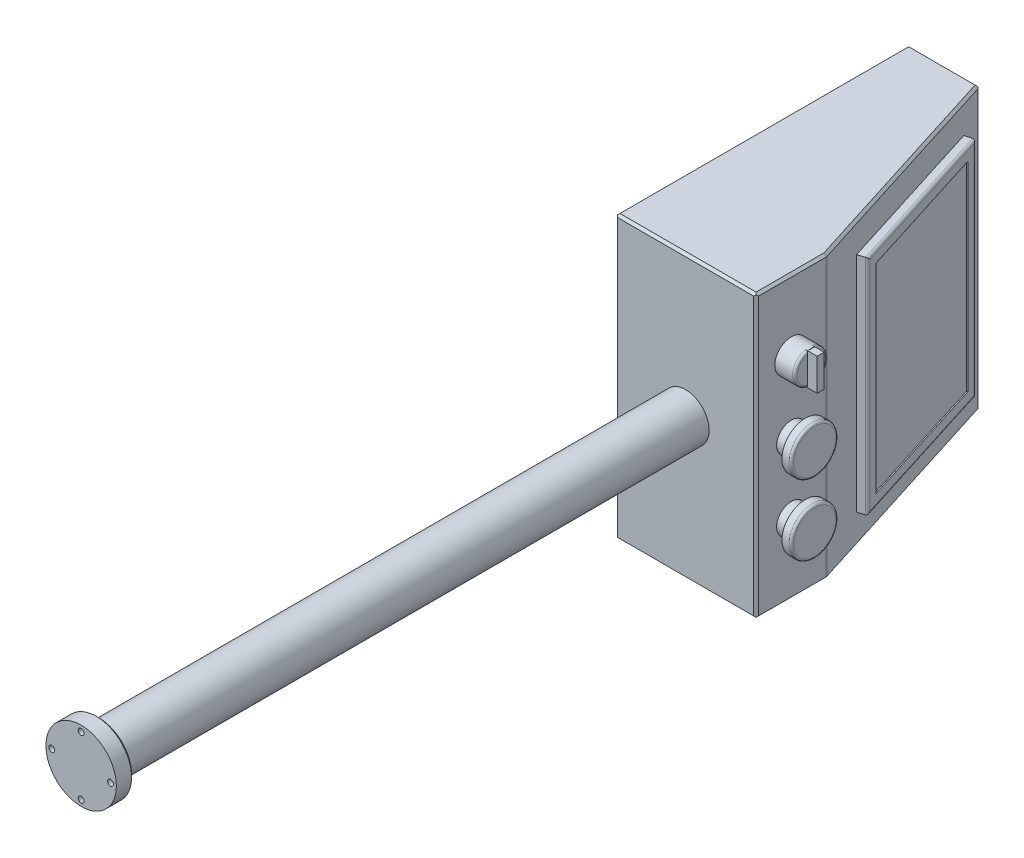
ISO-10303-21;
HEADER;
FILE_DESCRIPTION(('STEP AP214'),'2;1');
FILE_NAME('part.step','',(''),(''),'','','');
FILE_SCHEMA(('AUTOMOTIVE_DESIGN { 1 0 10303 214 1 1 1 1 }'));
ENDSEC;
DATA;
#1=APPLICATION_CONTEXT('core data for automotive mechanical design processes');
#2=APPLICATION_PROTOCOL_DEFINITION('international standard','automotive_design',2000,#1);
#3=PRODUCT_CONTEXT('',#1,'mechanical');
#4=PRODUCT('Part','Part','',(#3));
#5=PRODUCT_RELATED_PRODUCT_CATEGORY('part','',(#4));
#6=PRODUCT_DEFINITION_FORMATION('','',#4);
#7=PRODUCT_DEFINITION_CONTEXT('part definition',#1,'design');
#8=PRODUCT_DEFINITION('design','',#6,#7);
#9=PRODUCT_DEFINITION_SHAPE('','',#8);
#10=(LENGTH_UNIT() NAMED_UNIT(*) SI_UNIT(.MILLI.,.METRE.));
#11=(NAMED_UNIT(*) PLANE_ANGLE_UNIT() SI_UNIT($,.RADIAN.));
#12=(NAMED_UNIT(*) SI_UNIT($,.STERADIAN.) SOLID_ANGLE_UNIT());
#13=UNCERTAINTY_MEASURE_WITH_UNIT(LENGTH_MEASURE(1.E-05),#10,'distance_accuracy_value','');
#14=(GEOMETRIC_REPRESENTATION_CONTEXT(3) GLOBAL_UNCERTAINTY_ASSIGNED_CONTEXT((#13)) GLOBAL_UNIT_ASSIGNED_CONTEXT((#10,
#11,#12)) REPRESENTATION_CONTEXT('',''));
#15=CARTESIAN_POINT('',(0.,0.,0.));
#16=DIRECTION('',(0.,0.,1.));
#17=DIRECTION('',(1.,0.,0.));
#18=AXIS2_PLACEMENT_3D('',#15,#16,#17);
#19=CARTESIAN_POINT('',(80.,0.,0.));
#20=DIRECTION('',(1.,0.,0.));
#21=DIRECTION('',(0.,0.,-1.));
#22=AXIS2_PLACEMENT_3D('',#19,#20,#21);
#23=PLANE('',#22);
#24=CARTESIAN_POINT('',(80.,-60.,95.));
#25=DIRECTION('',(-1.,0.,0.));
#26=DIRECTION('',(0.,-1.,0.));
#27=AXIS2_PLACEMENT_3D('',#24,#25,#26);
#28=CIRCLE('',#27,18.);
#29=CARTESIAN_POINT('',(80.,-78.,95.));
#30=VERTEX_POINT('',#29);
#31=CARTESIAN_POINT('',(80.,-42.,95.));
#32=VERTEX_POINT('',#31);
#33=EDGE_CURVE('E867',#30,#32,#28,.T.);
#34=ORIENTED_EDGE('',*,*,#33,.F.);
#35=CARTESIAN_POINT('',(80.,-60.,95.));
#36=DIRECTION('',(-1.,0.,0.));
#37=DIRECTION('',(0.,1.,0.));
#38=AXIS2_PLACEMENT_3D('',#35,#36,#37);
#39=CIRCLE('',#38,18.);
#40=EDGE_CURVE('E866',#32,#30,#39,.T.);
#41=ORIENTED_EDGE('',*,*,#40,.F.);
#42=EDGE_LOOP('',(#34,#41));
#43=FACE_BOUND('',#42,.T.);
#44=ADVANCED_FACE('F16',(#43),#23,.T.);
#45=CARTESIAN_POINT('',(80.,0.,0.));
#46=DIRECTION('',(1.,0.,0.));
#47=DIRECTION('',(0.,0.,-1.));
#48=AXIS2_PLACEMENT_3D('',#45,#46,#47);
#49=PLANE('',#48);
#50=CARTESIAN_POINT('',(80.,0.,95.));
#51=DIRECTION('',(-1.,0.,0.));
#52=DIRECTION('',(0.,1.,0.));
#53=AXIS2_PLACEMENT_3D('',#50,#51,#52);
#54=CIRCLE('',#53,18.);
#55=CARTESIAN_POINT('',(80.,18.,95.));
#56=VERTEX_POINT('',#55);
#57=CARTESIAN_POINT('',(80.,-18.,95.));
#58=VERTEX_POINT('',#57);
#59=EDGE_CURVE('E496',#56,#58,#54,.T.);
#60=ORIENTED_EDGE('',*,*,#59,.F.);
#61=CARTESIAN_POINT('',(80.,0.,95.));
#62=DIRECTION('',(-1.,0.,0.));
#63=DIRECTION('',(0.,-1.,0.));
#64=AXIS2_PLACEMENT_3D('',#61,#62,#63);
#65=CIRCLE('',#64,18.);
#66=EDGE_CURVE('E523',#58,#56,#65,.T.);
#67=ORIENTED_EDGE('',*,*,#66,.F.);
#68=EDGE_LOOP('',(#60,#67));
#69=FACE_BOUND('',#68,.T.);
#70=ADVANCED_FACE('F502',(#69),#49,.T.);
#71=CARTESIAN_POINT('',(37.12847915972,-120.,-30.67215131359));
#72=DIRECTION('',(0.953582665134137,0.,-0.301131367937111));
#73=DIRECTION('',(-0.301131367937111,0.,-0.953582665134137));
#74=AXIS2_PLACEMENT_3D('',#71,#72,#73);
#75=PLANE('',#74);
#76=DIRECTION('',(0.,1.,0.));
#77=VECTOR('',#76,1.);
#78=CARTESIAN_POINT('',(15.7090196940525,-85.,-98.5004396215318));
#79=LINE('',#78,#77);
#80=CARTESIAN_POINT('',(15.7090196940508,-85.,-98.500439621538));
#81=VERTEX_POINT('',#80);
#82=CARTESIAN_POINT('',(15.7090196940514,85.,-98.500439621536));
#83=VERTEX_POINT('',#82);
#84=EDGE_CURVE('E548',#81,#83,#79,.T.);
#85=ORIENTED_EDGE('',*,*,#84,.T.);
#86=DIRECTION('',(0.301131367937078,0.,0.953582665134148));
#87=VECTOR('',#86,1.);
#88=CARTESIAN_POINT('',(15.70901969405,85.,-98.50043962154));
#89=LINE('',#88,#87);
#90=CARTESIAN_POINT('',(51.8447838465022,85.,15.9294801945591));
#91=VERTEX_POINT('',#90);
#92=EDGE_CURVE('E487',#83,#91,#89,.T.);
#93=ORIENTED_EDGE('',*,*,#92,.T.);
#94=DIRECTION('',(0.,1.,0.));
#95=VECTOR('',#94,1.);
#96=CARTESIAN_POINT('',(51.8447838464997,85.,15.9294801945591));
#97=LINE('',#96,#95);
#98=CARTESIAN_POINT('',(51.8447838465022,-85.,15.9294801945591));
#99=VERTEX_POINT('',#98);
#100=EDGE_CURVE('E879',#91,#99,#97,.F.);
#101=ORIENTED_EDGE('',*,*,#100,.T.);
#102=DIRECTION('',(-0.301131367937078,0.,-0.953582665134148));
#103=VECTOR('',#102,1.);
#104=CARTESIAN_POINT('',(51.8447838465,-85.,15.92948019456));
#105=LINE('',#104,#103);
#106=EDGE_CURVE('E871',#99,#81,#105,.T.);
#107=ORIENTED_EDGE('',*,*,#106,.T.);
#108=EDGE_LOOP('',(#85,#93,#101,#107));
#109=FACE_BOUND('',#108,.T.);
#110=ADVANCED_FACE('F511',(#109),#75,.T.);
#111=CARTESIAN_POINT('',(78.,-60.,95.));
#112=DIRECTION('',(1.,0.,0.));
#113=DIRECTION('',(0.,0.998042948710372,-0.0625321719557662));
#114=AXIS2_PLACEMENT_3D('',#111,#112,#113);
#115=TOROIDAL_SURFACE('',#114,18.,2.);
#116=CARTESIAN_POINT('',(78.,-60.,95.));
#117=DIRECTION('',(1.,0.,0.));
#118=DIRECTION('',(0.,0.,-1.));
#119=AXIS2_PLACEMENT_3D('',#116,#117,#118);
#120=CIRCLE('',#119,20.);
#121=CARTESIAN_POINT('',(78.,-60.,75.));
#122=VERTEX_POINT('',#121);
#123=EDGE_CURVE('E476',#122,#122,#120,.F.);
#124=ORIENTED_EDGE('',*,*,#123,.F.);
#125=EDGE_LOOP('',(#124));
#126=FACE_BOUND('',#125,.T.);
#127=ORIENTED_EDGE('',*,*,#33,.T.);
#128=ORIENTED_EDGE('',*,*,#40,.T.);
#129=EDGE_LOOP('',(#127,#128));
#130=FACE_BOUND('',#129,.T.);
#131=ADVANCED_FACE('F541',(#126,#130),#115,.T.);
#132=CARTESIAN_POINT('',(78.,0.,95.));
#133=DIRECTION('',(1.,0.,0.));
#134=DIRECTION('',(0.,0.998042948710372,-0.0625321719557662));
#135=AXIS2_PLACEMENT_3D('',#132,#133,#134);
#136=TOROIDAL_SURFACE('',#135,18.,2.);
#137=CARTESIAN_POINT('',(78.,0.,95.));
#138=DIRECTION('',(1.,0.,0.));
#139=DIRECTION('',(0.,0.,-1.));
#140=AXIS2_PLACEMENT_3D('',#137,#138,#139);
#141=CIRCLE('',#140,20.);
#142=CARTESIAN_POINT('',(78.,0.,75.));
#143=VERTEX_POINT('',#142);
#144=EDGE_CURVE('E331',#143,#143,#141,.F.);
#145=ORIENTED_EDGE('',*,*,#144,.F.);
#146=EDGE_LOOP('',(#145));
#147=FACE_BOUND('',#146,.T.);
#148=ORIENTED_EDGE('',*,*,#66,.T.);
#149=ORIENTED_EDGE('',*,*,#59,.T.);
#150=EDGE_LOOP('',(#148,#149));
#151=FACE_BOUND('',#150,.T.);
#152=ADVANCED_FACE('F530',(#147,#151),#136,.T.);
#153=CARTESIAN_POINT('',(16.66260235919,-85.,-98.80157098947));
#154=DIRECTION('',(-0.301131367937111,0.,-0.953582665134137));
#155=DIRECTION('',(-0.953582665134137,0.,0.301131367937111));
#156=AXIS2_PLACEMENT_3D('',#153,#154,#155);
#157=PLANE('',#156);
#158=ORIENTED_EDGE('',*,*,#84,.F.);
#159=DIRECTION('',(0.953582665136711,0.,-0.301131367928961));
#160=VECTOR('',#159,1.);
#161=CARTESIAN_POINT('',(15.70901969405,-85.,-98.50043962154));
#162=LINE('',#161,#160);
#163=CARTESIAN_POINT('',(16.6626023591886,-85.,-98.8015709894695));
#164=VERTEX_POINT('',#163);
#165=EDGE_CURVE('E876',#81,#164,#162,.T.);
#166=ORIENTED_EDGE('',*,*,#165,.T.);
#167=DIRECTION('',(0.,1.,0.));
#168=VECTOR('',#167,1.);
#169=CARTESIAN_POINT('',(16.6626023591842,-120.,-98.8015709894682));
#170=LINE('',#169,#168);
#171=CARTESIAN_POINT('',(16.6626023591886,85.,-98.8015709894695));
#172=VERTEX_POINT('',#171);
#173=EDGE_CURVE('E329',#172,#164,#170,.F.);
#174=ORIENTED_EDGE('',*,*,#173,.F.);
#175=DIRECTION('',(-0.953582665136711,0.,0.301131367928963));
#176=VECTOR('',#175,1.);
#177=CARTESIAN_POINT('',(16.66260235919,85.,-98.80157098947));
#178=LINE('',#177,#176);
#179=EDGE_CURVE('E886',#172,#83,#178,.T.);
#180=ORIENTED_EDGE('',*,*,#179,.T.);
#181=EDGE_LOOP('',(#158,#166,#174,#180));
#182=FACE_BOUND('',#181,.T.);
#183=ADVANCED_FACE('F540',(#182),#157,.F.);
#184=CARTESIAN_POINT('',(52.79836651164,-85.,15.62834882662));
#185=DIRECTION('',(0.,-1.,0.));
#186=DIRECTION('',(0.,0.,-1.));
#187=AXIS2_PLACEMENT_3D('',#184,#185,#186);
#188=PLANE('',#187);
#189=ORIENTED_EDGE('',*,*,#106,.F.);
#190=DIRECTION('',(0.953582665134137,0.,-0.301131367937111));
#191=VECTOR('',#190,1.);
#192=CARTESIAN_POINT('',(52.79836651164,-85.,15.62834882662));
#193=LINE('',#192,#191);
#194=CARTESIAN_POINT('',(52.7983665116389,-85.,15.6283488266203));
#195=VERTEX_POINT('',#194);
#196=EDGE_CURVE('E883',#99,#195,#193,.T.);
#197=ORIENTED_EDGE('',*,*,#196,.T.);
#198=DIRECTION('',(-0.301131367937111,0.,-0.953582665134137));
#199=VECTOR('',#198,1.);
#200=CARTESIAN_POINT('',(38.08206182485,-85.,-30.97328268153));
#201=LINE('',#200,#199);
#202=EDGE_CURVE('E327',#164,#195,#201,.F.);
#203=ORIENTED_EDGE('',*,*,#202,.F.);
#204=ORIENTED_EDGE('',*,*,#165,.F.);
#205=EDGE_LOOP('',(#189,#197,#203,#204));
#206=FACE_BOUND('',#205,.T.);
#207=ADVANCED_FACE('F904',(#206),#188,.F.);
#208=CARTESIAN_POINT('',(52.79836651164,85.,15.62834882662));
#209=DIRECTION('',(0.301131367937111,0.,0.953582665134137));
#210=DIRECTION('',(0.953582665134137,0.,-0.301131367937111));
#211=AXIS2_PLACEMENT_3D('',#208,#209,#210);
#212=PLANE('',#211);
#213=ORIENTED_EDGE('',*,*,#100,.F.);
#214=DIRECTION('',(0.953582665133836,0.,-0.301131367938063));
#215=VECTOR('',#214,1.);
#216=CARTESIAN_POINT('',(51.8447838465,85.,15.92948019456));
#217=LINE('',#216,#215);
#218=CARTESIAN_POINT('',(52.7983665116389,85.,15.6283488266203));
#219=VERTEX_POINT('',#218);
#220=EDGE_CURVE('E482',#91,#219,#217,.T.);
#221=ORIENTED_EDGE('',*,*,#220,.T.);
#222=DIRECTION('',(0.,1.,0.));
#223=VECTOR('',#222,1.);
#224=CARTESIAN_POINT('',(52.7983665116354,-120.,15.6283488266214));
#225=LINE('',#224,#223);
#226=EDGE_CURVE('E325',#195,#219,#225,.T.);
#227=ORIENTED_EDGE('',*,*,#226,.F.);
#228=ORIENTED_EDGE('',*,*,#196,.F.);
#229=EDGE_LOOP('',(#213,#221,#227,#228));
#230=FACE_BOUND('',#229,.T.);
#231=ADVANCED_FACE('F902',(#230),#212,.F.);
#232=CARTESIAN_POINT('',(16.66260235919,85.,-98.80157098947));
#233=DIRECTION('',(0.,1.,0.));
#234=DIRECTION('',(0.,0.,1.));
#235=AXIS2_PLACEMENT_3D('',#232,#233,#234);
#236=PLANE('',#235);
#237=ORIENTED_EDGE('',*,*,#92,.F.);
#238=ORIENTED_EDGE('',*,*,#179,.F.);
#239=DIRECTION('',(-0.301131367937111,0.,-0.953582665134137));
#240=VECTOR('',#239,1.);
#241=CARTESIAN_POINT('',(38.08206182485,85.,-30.97328268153));
#242=LINE('',#241,#240);
#243=EDGE_CURVE('E321',#219,#172,#242,.T.);
#244=ORIENTED_EDGE('',*,*,#243,.F.);
#245=ORIENTED_EDGE('',*,*,#220,.F.);
#246=EDGE_LOOP('',(#237,#238,#244,#245));
#247=FACE_BOUND('',#246,.T.);
#248=ADVANCED_FACE('F892',(#247),#236,.F.);
#249=CARTESIAN_POINT('',(72.,-60.,95.));
#250=DIRECTION('',(1.,0.,0.));
#251=DIRECTION('',(0.,0.,-1.));
#252=AXIS2_PLACEMENT_3D('',#249,#250,#251);
#253=CYLINDRICAL_SURFACE('',#252,20.);
#254=CARTESIAN_POINT('',(72.,-60.,95.));
#255=DIRECTION('',(1.,0.,0.));
#256=DIRECTION('',(0.,0.,-1.));
#257=AXIS2_PLACEMENT_3D('',#254,#255,#256);
#258=CIRCLE('',#257,20.);
#259=CARTESIAN_POINT('',(72.,-60.,75.));
#260=VERTEX_POINT('',#259);
#261=EDGE_CURVE('E851',#260,#260,#258,.T.);
#262=ORIENTED_EDGE('',*,*,#261,.T.);
#263=EDGE_LOOP('',(#262));
#264=FACE_BOUND('',#263,.T.);
#265=ORIENTED_EDGE('',*,*,#123,.T.);
#266=EDGE_LOOP('',(#265));
#267=FACE_BOUND('',#266,.T.);
#268=ADVANCED_FACE('F370',(#264,#267),#253,.T.);
#269=CARTESIAN_POINT('',(77.,0.,0.));
#270=DIRECTION('',(1.,0.,0.));
#271=DIRECTION('',(0.,0.,-1.));
#272=AXIS2_PLACEMENT_3D('',#269,#270,#271);
#273=PLANE('',#272);
#274=DIRECTION('',(0.,1.,0.));
#275=VECTOR('',#274,1.);
#276=CARTESIAN_POINT('',(77.,73.67479433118,98.));
#277=LINE('',#276,#275);
#278=CARTESIAN_POINT('',(77.,71.61895003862,98.));
#279=VERTEX_POINT('',#278);
#280=CARTESIAN_POINT('',(77.,48.38104996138,98.));
#281=VERTEX_POINT('',#280);
#282=EDGE_CURVE('E292',#279,#281,#277,.F.);
#283=ORIENTED_EDGE('',*,*,#282,.F.);
#284=CARTESIAN_POINT('',(77.,60.,95.));
#285=DIRECTION('',(-1.,0.,0.));
#286=DIRECTION('',(0.,-0.968245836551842,0.250000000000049));
#287=AXIS2_PLACEMENT_3D('',#284,#285,#286);
#288=CIRCLE('',#287,11.9999999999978);
#289=EDGE_CURVE('E296',#281,#279,#288,.T.);
#290=ORIENTED_EDGE('',*,*,#289,.F.);
#291=EDGE_LOOP('',(#283,#290));
#292=FACE_BOUND('',#291,.T.);
#293=ADVANCED_FACE('F365',(#292),#273,.T.);
#294=CARTESIAN_POINT('',(85.,0.,0.));
#295=DIRECTION('',(1.,0.,0.));
#296=DIRECTION('',(0.,0.,-1.));
#297=AXIS2_PLACEMENT_3D('',#294,#295,#296);
#298=PLANE('',#297);
#299=DIRECTION('',(0.,1.,0.));
#300=VECTOR('',#299,1.);
#301=CARTESIAN_POINT('',(85.,46.32520566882,92.));
#302=LINE('',#301,#300);
#303=CARTESIAN_POINT('',(85.,73.67479433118,92.));
#304=VERTEX_POINT('',#303);
#305=CARTESIAN_POINT('',(85.,46.32520566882,92.));
#306=VERTEX_POINT('',#305);
#307=EDGE_CURVE('E413',#304,#306,#302,.F.);
#308=ORIENTED_EDGE('',*,*,#307,.F.);
#309=DIRECTION('',(0.,0.,1.));
#310=VECTOR('',#309,1.);
#311=CARTESIAN_POINT('',(85.,73.67479433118,92.));
#312=LINE('',#311,#310);
#313=CARTESIAN_POINT('',(85.,73.67479433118,98.));
#314=VERTEX_POINT('',#313);
#315=EDGE_CURVE('E463',#314,#304,#312,.F.);
#316=ORIENTED_EDGE('',*,*,#315,.F.);
#317=DIRECTION('',(0.,1.,0.));
#318=VECTOR('',#317,1.);
#319=CARTESIAN_POINT('',(85.,73.67479433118,98.));
#320=LINE('',#319,#318);
#321=CARTESIAN_POINT('',(85.,46.32520566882,98.));
#322=VERTEX_POINT('',#321);
#323=EDGE_CURVE('E318',#322,#314,#320,.T.);
#324=ORIENTED_EDGE('',*,*,#323,.F.);
#325=DIRECTION('',(0.,0.,-1.));
#326=VECTOR('',#325,1.);
#327=CARTESIAN_POINT('',(85.,46.32520566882,98.));
#328=LINE('',#327,#326);
#329=EDGE_CURVE('E470',#306,#322,#328,.F.);
#330=ORIENTED_EDGE('',*,*,#329,.F.);
#331=EDGE_LOOP('',(#308,#316,#324,#330));
#332=FACE_BOUND('',#331,.T.);
#333=ADVANCED_FACE('F361',(#332),#298,.T.);
#334=CARTESIAN_POINT('',(77.,46.32520566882,98.));
#335=DIRECTION('',(0.,-1.,0.));
#336=DIRECTION('',(0.,0.,-1.));
#337=AXIS2_PLACEMENT_3D('',#334,#335,#336);
#338=PLANE('',#337);
#339=ORIENTED_EDGE('',*,*,#329,.T.);
#340=DIRECTION('',(1.,0.,0.));
#341=VECTOR('',#340,1.);
#342=CARTESIAN_POINT('',(77.,46.32520566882,98.));
#343=LINE('',#342,#341);
#344=CARTESIAN_POINT('',(77.,46.32520566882,97.999999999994));
#345=VERTEX_POINT('',#344);
#346=EDGE_CURVE('E309',#345,#322,#343,.T.);
#347=ORIENTED_EDGE('',*,*,#346,.F.);
#348=DIRECTION('',(0.,0.,-1.));
#349=VECTOR('',#348,1.);
#350=CARTESIAN_POINT('',(77.,46.32520566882,0.));
#351=LINE('',#350,#349);
#352=CARTESIAN_POINT('',(77.,46.32520566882,92.000000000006));
#353=VERTEX_POINT('',#352);
#354=EDGE_CURVE('E414',#353,#345,#351,.F.);
#355=ORIENTED_EDGE('',*,*,#354,.F.);
#356=DIRECTION('',(-1.,0.,0.));
#357=VECTOR('',#356,1.);
#358=CARTESIAN_POINT('',(77.,46.32520566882,92.));
#359=LINE('',#358,#357);
#360=EDGE_CURVE('E410',#306,#353,#359,.T.);
#361=ORIENTED_EDGE('',*,*,#360,.F.);
#362=EDGE_LOOP('',(#339,#347,#355,#361));
#363=FACE_BOUND('',#362,.T.);
#364=ADVANCED_FACE('F357',(#363),#338,.T.);
#365=CARTESIAN_POINT('',(77.,73.67479433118,92.));
#366=DIRECTION('',(0.,1.,0.));
#367=DIRECTION('',(0.,0.,1.));
#368=AXIS2_PLACEMENT_3D('',#365,#366,#367);
#369=PLANE('',#368);
#370=ORIENTED_EDGE('',*,*,#315,.T.);
#371=DIRECTION('',(-1.,0.,0.));
#372=VECTOR('',#371,1.);
#373=CARTESIAN_POINT('',(77.,73.67479433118,92.));
#374=LINE('',#373,#372);
#375=CARTESIAN_POINT('',(77.,73.67479433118,92.0000000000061));
#376=VERTEX_POINT('',#375);
#377=EDGE_CURVE('E420',#376,#304,#374,.F.);
#378=ORIENTED_EDGE('',*,*,#377,.F.);
#379=DIRECTION('',(0.,0.,-1.));
#380=VECTOR('',#379,1.);
#381=CARTESIAN_POINT('',(77.,73.67479433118,0.));
#382=LINE('',#381,#380);
#383=CARTESIAN_POINT('',(77.,73.67479433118,97.9999999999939));
#384=VERTEX_POINT('',#383);
#385=EDGE_CURVE('E416',#384,#376,#382,.T.);
#386=ORIENTED_EDGE('',*,*,#385,.F.);
#387=DIRECTION('',(1.,0.,0.));
#388=VECTOR('',#387,1.);
#389=CARTESIAN_POINT('',(77.,73.67479433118,98.));
#390=LINE('',#389,#388);
#391=EDGE_CURVE('E310',#314,#384,#390,.F.);
#392=ORIENTED_EDGE('',*,*,#391,.F.);
#393=EDGE_LOOP('',(#370,#378,#386,#392));
#394=FACE_BOUND('',#393,.T.);
#395=ADVANCED_FACE('F353',(#394),#369,.T.);
#396=CARTESIAN_POINT('',(77.,0.,0.));
#397=DIRECTION('',(1.,0.,0.));
#398=DIRECTION('',(0.,0.,-1.));
#399=AXIS2_PLACEMENT_3D('',#396,#397,#398);
#400=PLANE('',#399);
#401=DIRECTION('',(0.,1.,0.));
#402=VECTOR('',#401,1.);
#403=CARTESIAN_POINT('',(77.,46.32520566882,92.));
#404=LINE('',#403,#402);
#405=CARTESIAN_POINT('',(77.,48.38104996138,92.));
#406=VERTEX_POINT('',#405);
#407=CARTESIAN_POINT('',(77.,71.61895003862,92.));
#408=VERTEX_POINT('',#407);
#409=EDGE_CURVE('E412',#406,#408,#404,.T.);
#410=ORIENTED_EDGE('',*,*,#409,.F.);
#411=CARTESIAN_POINT('',(77.,60.,95.));
#412=DIRECTION('',(-1.,0.,0.));
#413=DIRECTION('',(0.,0.968245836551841,-0.25000000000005));
#414=AXIS2_PLACEMENT_3D('',#411,#412,#413);
#415=CIRCLE('',#414,11.9999999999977);
#416=EDGE_CURVE('E336',#408,#406,#415,.T.);
#417=ORIENTED_EDGE('',*,*,#416,.F.);
#418=EDGE_LOOP('',(#410,#417));
#419=FACE_BOUND('',#418,.T.);
#420=ADVANCED_FACE('F342',(#419),#400,.T.);
#421=CARTESIAN_POINT('',(72.,0.,95.));
#422=DIRECTION('',(1.,0.,0.));
#423=DIRECTION('',(0.,0.,-1.));
#424=AXIS2_PLACEMENT_3D('',#421,#422,#423);
#425=CYLINDRICAL_SURFACE('',#424,20.);
#426=CARTESIAN_POINT('',(72.,0.,95.));
#427=DIRECTION('',(1.,0.,0.));
#428=DIRECTION('',(0.,0.,-1.));
#429=AXIS2_PLACEMENT_3D('',#426,#427,#428);
#430=CIRCLE('',#429,20.);
#431=CARTESIAN_POINT('',(72.,0.,75.));
#432=VERTEX_POINT('',#431);
#433=EDGE_CURVE('E827',#432,#432,#430,.T.);
#434=ORIENTED_EDGE('',*,*,#433,.T.);
#435=EDGE_LOOP('',(#434));
#436=FACE_BOUND('',#435,.T.);
#437=ORIENTED_EDGE('',*,*,#144,.T.);
#438=EDGE_LOOP('',(#437));
#439=FACE_BOUND('',#438,.T.);
#440=ADVANCED_FACE('F352',(#436,#439),#425,.T.);
#441=CARTESIAN_POINT('',(38.08206182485,-120.,-30.97328268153));
#442=DIRECTION('',(0.953582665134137,0.,-0.301131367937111));
#443=DIRECTION('',(-0.301131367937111,0.,-0.953582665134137));
#444=AXIS2_PLACEMENT_3D('',#441,#442,#443);
#445=PLANE('',#444);
#446=ORIENTED_EDGE('',*,*,#226,.T.);
#447=ORIENTED_EDGE('',*,*,#243,.T.);
#448=ORIENTED_EDGE('',*,*,#173,.T.);
#449=ORIENTED_EDGE('',*,*,#202,.T.);
#450=EDGE_LOOP('',(#446,#447,#448,#449));
#451=FACE_BOUND('',#450,.T.);
#452=DIRECTION('',(0.,-1.,0.));
#453=VECTOR('',#452,1.);
#454=CARTESIAN_POINT('',(55.2074174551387,432.864,23.2570101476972));
#455=LINE('',#454,#453);
#456=CARTESIAN_POINT('',(55.2074174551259,-93.,23.2570101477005));
#457=VERTEX_POINT('',#456);
#458=CARTESIAN_POINT('',(55.2074174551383,93.,23.2570101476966));
#459=VERTEX_POINT('',#458);
#460=EDGE_CURVE('E810',#457,#459,#455,.F.);
#461=ORIENTED_EDGE('',*,*,#460,.F.);
#462=DIRECTION('',(-0.301131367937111,0.,-0.953582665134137));
#463=VECTOR('',#462,1.);
#464=CARTESIAN_POINT('',(275.929165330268,-93.,722.209211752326));
#465=LINE('',#464,#463);
#466=CARTESIAN_POINT('',(14.2535514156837,-92.9999999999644,-106.430232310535));
#467=VERTEX_POINT('',#466);
#468=EDGE_CURVE('E797',#467,#457,#465,.F.);
#469=ORIENTED_EDGE('',*,*,#468,.F.);
#470=DIRECTION('',(0.,1.,0.));
#471=VECTOR('',#470,1.);
#472=CARTESIAN_POINT('',(14.2535514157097,-432.864,-106.430232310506));
#473=LINE('',#472,#471);
#474=CARTESIAN_POINT('',(14.2535514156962,92.9999999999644,-106.430232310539));
#475=VERTEX_POINT('',#474);
#476=EDGE_CURVE('E749',#475,#467,#473,.F.);
#477=ORIENTED_EDGE('',*,*,#476,.F.);
#478=DIRECTION('',(0.301131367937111,0.,0.953582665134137));
#479=VECTOR('',#478,1.);
#480=CARTESIAN_POINT('',(-247.114834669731,93.,-934.096788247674));
#481=LINE('',#480,#479);
#482=EDGE_CURVE('E436',#459,#475,#481,.F.);
#483=ORIENTED_EDGE('',*,*,#482,.F.);
#484=EDGE_LOOP('',(#461,#469,#477,#483));
#485=FACE_BOUND('',#484,.T.);
#486=ADVANCED_FACE('F554',(#451,#485),#445,.T.);
#487=CARTESIAN_POINT('',(0.,0.,625.));
#488=DIRECTION('',(0.,0.,1.));
#489=DIRECTION('',(1.,0.,0.));
#490=AXIS2_PLACEMENT_3D('',#487,#488,#489);
#491=CYLINDRICAL_SURFACE('',#490,30.);
#492=CARTESIAN_POINT('',(0.,0.,640.));
#493=DIRECTION('',(0.,0.,1.));
#494=DIRECTION('',(1.,0.,0.));
#495=AXIS2_PLACEMENT_3D('',#492,#493,#494);
#496=CIRCLE('',#495,30.);
#497=CARTESIAN_POINT('',(30.,0.,640.));
#498=VERTEX_POINT('',#497);
#499=EDGE_CURVE('E324',#498,#498,#496,.T.);
#500=ORIENTED_EDGE('',*,*,#499,.F.);
#501=EDGE_LOOP('',(#500));
#502=FACE_BOUND('',#501,.T.);
#503=CARTESIAN_POINT('',(0.,0.,627.00103527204));
#504=DIRECTION('',(0.,0.,1.));
#505=DIRECTION('',(1.,0.,0.));
#506=AXIS2_PLACEMENT_3D('',#503,#504,#505);
#507=CIRCLE('',#506,30.);
#508=CARTESIAN_POINT('',(30.,0.,627.00103527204));
#509=VERTEX_POINT('',#508);
#510=EDGE_CURVE('E945',#509,#509,#507,.F.);
#511=ORIENTED_EDGE('',*,*,#510,.F.);
#512=EDGE_LOOP('',(#511));
#513=FACE_BOUND('',#512,.T.);
#514=ADVANCED_FACE('F561',(#502,#513),#491,.T.);
#515=CARTESIAN_POINT('',(-60.,0.,640.));
#516=DIRECTION('',(0.,0.,1.));
#517=DIRECTION('',(1.,0.,0.));
#518=AXIS2_PLACEMENT_3D('',#515,#516,#517);
#519=PLANE('',#518);
#520=CARTESIAN_POINT('',(-25.,0.,640.));
#521=DIRECTION('',(0.,0.,1.));
#522=DIRECTION('',(1.,0.,0.));
#523=AXIS2_PLACEMENT_3D('',#520,#521,#522);
#524=CIRCLE('',#523,2.5);
#525=CARTESIAN_POINT('',(-22.5,0.,640.));
#526=VERTEX_POINT('',#525);
#527=EDGE_CURVE('E958',#526,#526,#524,.F.);
#528=ORIENTED_EDGE('',*,*,#527,.T.);
#529=EDGE_LOOP('',(#528));
#530=FACE_BOUND('',#529,.T.);
#531=CARTESIAN_POINT('',(0.,25.,640.));
#532=DIRECTION('',(0.,0.,1.));
#533=DIRECTION('',(1.,0.,0.));
#534=AXIS2_PLACEMENT_3D('',#531,#532,#533);
#535=CIRCLE('',#534,2.5);
#536=CARTESIAN_POINT('',(2.5,25.,640.));
#537=VERTEX_POINT('',#536);
#538=EDGE_CURVE('E955',#537,#537,#535,.F.);
#539=ORIENTED_EDGE('',*,*,#538,.T.);
#540=EDGE_LOOP('',(#539));
#541=FACE_BOUND('',#540,.T.);
#542=CARTESIAN_POINT('',(25.,0.,640.));
#543=DIRECTION('',(0.,0.,1.));
#544=DIRECTION('',(1.,0.,0.));
#545=AXIS2_PLACEMENT_3D('',#542,#543,#544);
#546=CIRCLE('',#545,2.5);
#547=CARTESIAN_POINT('',(27.5,0.,640.));
#548=VERTEX_POINT('',#547);
#549=EDGE_CURVE('E949',#548,#548,#546,.F.);
#550=ORIENTED_EDGE('',*,*,#549,.T.);
#551=EDGE_LOOP('',(#550));
#552=FACE_BOUND('',#551,.T.);
#553=CARTESIAN_POINT('',(0.,-25.,640.));
#554=DIRECTION('',(0.,0.,1.));
#555=DIRECTION('',(1.,0.,0.));
#556=AXIS2_PLACEMENT_3D('',#553,#554,#555);
#557=CIRCLE('',#556,2.5);
#558=CARTESIAN_POINT('',(2.5,-25.,640.));
#559=VERTEX_POINT('',#558);
#560=EDGE_CURVE('E946',#559,#559,#557,.F.);
#561=ORIENTED_EDGE('',*,*,#560,.T.);
#562=EDGE_LOOP('',(#561));
#563=FACE_BOUND('',#562,.T.);
#564=ORIENTED_EDGE('',*,*,#499,.T.);
#565=EDGE_LOOP('',(#564));
#566=FACE_BOUND('',#565,.T.);
#567=ADVANCED_FACE('F925',(#530,#541,#552,#563,#566),#519,.T.);
#568=CARTESIAN_POINT('',(72.,0.,0.));
#569=DIRECTION('',(1.,0.,0.));
#570=DIRECTION('',(0.,0.,-1.));
#571=AXIS2_PLACEMENT_3D('',#568,#569,#570);
#572=PLANE('',#571);
#573=CARTESIAN_POINT('',(72.,-60.,95.));
#574=DIRECTION('',(1.,0.,0.));
#575=DIRECTION('',(0.,0.,-1.));
#576=AXIS2_PLACEMENT_3D('',#573,#574,#575);
#577=CIRCLE('',#576,12.5);
#578=CARTESIAN_POINT('',(72.,-60.,82.5));
#579=VERTEX_POINT('',#578);
#580=EDGE_CURVE('E307',#579,#579,#577,.F.);
#581=ORIENTED_EDGE('',*,*,#580,.F.);
#582=EDGE_LOOP('',(#581));
#583=FACE_BOUND('',#582,.T.);
#584=ORIENTED_EDGE('',*,*,#261,.F.);
#585=EDGE_LOOP('',(#584));
#586=FACE_BOUND('',#585,.T.);
#587=ADVANCED_FACE('F923',(#583,#586),#572,.F.);
#588=CARTESIAN_POINT('',(77.,73.67479433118,98.));
#589=DIRECTION('',(0.,0.,1.));
#590=DIRECTION('',(1.,0.,0.));
#591=AXIS2_PLACEMENT_3D('',#588,#589,#590);
#592=PLANE('',#591);
#593=DIRECTION('',(1.,0.,0.));
#594=VECTOR('',#593,1.);
#595=CARTESIAN_POINT('',(60.,46.3252056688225,98.));
#596=LINE('',#595,#594);
#597=CARTESIAN_POINT('',(75.,46.3252056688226,98.));
#598=VERTEX_POINT('',#597);
#599=EDGE_CURVE('E273',#345,#598,#596,.F.);
#600=ORIENTED_EDGE('',*,*,#599,.F.);
#601=ORIENTED_EDGE('',*,*,#346,.T.);
#602=ORIENTED_EDGE('',*,*,#323,.T.);
#603=ORIENTED_EDGE('',*,*,#391,.T.);
#604=DIRECTION('',(1.,0.,0.));
#605=VECTOR('',#604,1.);
#606=CARTESIAN_POINT('',(60.,73.6747943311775,98.));
#607=LINE('',#606,#605);
#608=CARTESIAN_POINT('',(75.,73.6747943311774,98.));
#609=VERTEX_POINT('',#608);
#610=EDGE_CURVE('E286',#609,#384,#607,.T.);
#611=ORIENTED_EDGE('',*,*,#610,.F.);
#612=CARTESIAN_POINT('',(77.,71.61895003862,98.));
#613=CARTESIAN_POINT('',(76.9999957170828,71.6781143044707,98.));
#614=CARTESIAN_POINT('',(76.9975363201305,71.7372411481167,98.));
#615=CARTESIAN_POINT('',(76.9877018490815,71.8550839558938,98.));
#616=CARTESIAN_POINT('',(76.980326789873,71.9137999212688,98.));
#617=CARTESIAN_POINT('',(76.9508312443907,72.0887608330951,98.));
#618=CARTESIAN_POINT('',(76.9213403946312,72.2038876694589,98.));
#619=CARTESIAN_POINT('',(76.8629012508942,72.3714992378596,98.));
#620=CARTESIAN_POINT('',(76.8410250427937,72.4265764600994,98.));
#621=CARTESIAN_POINT('',(76.7926528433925,72.5346711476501,98.));
#622=CARTESIAN_POINT('',(76.7661579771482,72.5876891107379,98.));
#623=CARTESIAN_POINT('',(76.7087340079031,72.6912030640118,98.));
#624=CARTESIAN_POINT('',(76.6778089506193,72.7417012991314,98.));
#625=CARTESIAN_POINT('',(76.6116850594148,72.8398788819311,98.));
#626=CARTESIAN_POINT('',(76.5764817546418,72.8875552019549,98.));
#627=CARTESIAN_POINT('',(76.4662366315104,73.0239553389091,98.));
#628=CARTESIAN_POINT('',(76.3854111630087,73.1081135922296,98.));
#629=CARTESIAN_POINT('',(76.2104277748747,73.2611789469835,98.));
#630=CARTESIAN_POINT('',(76.1162731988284,73.330089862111,98.));
#631=CARTESIAN_POINT('',(75.9684946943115,73.4195272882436,98.));
#632=CARTESIAN_POINT('',(75.9188213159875,73.4467540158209,98.));
#633=CARTESIAN_POINT('',(75.8173536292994,73.4968337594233,98.));
#634=CARTESIAN_POINT('',(75.7655611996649,73.5196905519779,98.));
#635=CARTESIAN_POINT('',(75.6602275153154,73.5608503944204,98.));
#636=CARTESIAN_POINT('',(75.6066870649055,73.5791555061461,98.));
#637=CARTESIAN_POINT('',(75.4982328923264,73.6110767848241,98.));
#638=CARTESIAN_POINT('',(75.443319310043,73.6246934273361,98.));
#639=CARTESIAN_POINT('',(75.3240803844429,73.6488299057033,98.));
#640=CARTESIAN_POINT('',(75.2595943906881,73.6585632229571,98.));
#641=CARTESIAN_POINT('',(75.1300708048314,73.6715475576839,98.));
#642=CARTESIAN_POINT('',(75.0650341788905,73.6748082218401,98.));
#643=CARTESIAN_POINT('',(75.,73.6747943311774,98.));
#644=B_SPLINE_CURVE_WITH_KNOTS('',3,(#612,#613,#614,#615,#616,#617,#618,#619,#620,#621,#622,
#623,#624,#625,#626,#627,#628,#629,#630,#631,#632,#633,#634,#635,#636,#637,#638,#639,#640,#641,
#642,#643),.UNSPECIFIED.,.F.,.F.,(4,2,2,2,2,2,2,2,2,2,2,2,2,2,2,4),(0.,0.177366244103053,
0.354731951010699,0.709259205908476,0.886882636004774,1.06446285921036,1.24188193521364,
1.41948803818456,1.7677108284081,2.11584642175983,2.28561092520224,2.4552280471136,
2.62476819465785,2.79429114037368,2.98960979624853,3.18463713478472),.UNSPECIFIED.);
#645=EDGE_CURVE('E297',#279,#609,#644,.T.);
#646=ORIENTED_EDGE('',*,*,#645,.F.);
#647=ORIENTED_EDGE('',*,*,#282,.T.);
#648=CARTESIAN_POINT('',(75.,46.3252056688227,98.));
#649=CARTESIAN_POINT('',(75.0552800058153,46.3252054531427,98.));
#650=CARTESIAN_POINT('',(75.1105332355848,46.3275536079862,98.));
#651=CARTESIAN_POINT('',(75.2206378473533,46.3369173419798,98.));
#652=CARTESIAN_POINT('',(75.2754892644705,46.3439325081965,98.));
#653=CARTESIAN_POINT('',(75.4386894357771,46.371893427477,98.));
#654=CARTESIAN_POINT('',(75.5459344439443,46.3997549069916,98.));
#655=CARTESIAN_POINT('',(75.7542040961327,46.473054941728,98.));
#656=CARTESIAN_POINT('',(75.8552269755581,46.5184984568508,98.));
#657=CARTESIAN_POINT('',(76.0483120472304,46.625552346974,98.));
#658=CARTESIAN_POINT('',(76.1403743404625,46.6871625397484,98.));
#659=CARTESIAN_POINT('',(76.3138778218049,46.8253189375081,98.));
#660=CARTESIAN_POINT('',(76.3952145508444,46.9019961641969,98.));
#661=CARTESIAN_POINT('',(76.5442096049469,47.06766336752,98.));
#662=CARTESIAN_POINT('',(76.6118652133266,47.1566557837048,98.));
#663=CARTESIAN_POINT('',(76.7332042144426,47.3465132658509,98.));
#664=CARTESIAN_POINT('',(76.7865414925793,47.4475992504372,98.));
#665=CARTESIAN_POINT('',(76.8759742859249,47.6571267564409,98.));
#666=CARTESIAN_POINT('',(76.9120720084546,47.7655673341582,98.));
#667=CARTESIAN_POINT('',(76.9594148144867,47.9587577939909,98.));
#668=CARTESIAN_POINT('',(76.9746373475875,48.0425587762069,98.));
#669=CARTESIAN_POINT('',(76.9949297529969,48.2112499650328,98.));
#670=CARTESIAN_POINT('',(77.0000153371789,48.2961382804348,98.));
#671=CARTESIAN_POINT('',(77.,48.38104996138,98.));
#672=B_SPLINE_CURVE_WITH_KNOTS('',3,(#648,#649,#650,#651,#652,#653,#654,#655,#656,#657,#658,
#659,#660,#661,#662,#663,#664,#665,#666,#667,#668,#669,#670,#671),.UNSPECIFIED.,.F.,.F.,(4,2,2,
2,2,2,2,2,2,2,2,4),(0.,0.165737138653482,0.331459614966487,0.662163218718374,0.992960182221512,
1.32375341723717,1.6575618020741,1.99143640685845,2.33277389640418,2.67406767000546,
2.92899799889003,3.18353288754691),.UNSPECIFIED.);
#673=EDGE_CURVE('E289',#598,#281,#672,.T.);
#674=ORIENTED_EDGE('',*,*,#673,.F.);
#675=EDGE_LOOP('',(#600,#601,#602,#603,#611,#646,#647,#674));
#676=FACE_BOUND('',#675,.T.);
#677=ADVANCED_FACE('F290',(#676),#592,.T.);
#678=CARTESIAN_POINT('',(75.,60.,95.));
#679=DIRECTION('',(1.,0.,0.));
#680=DIRECTION('',(0.,0.00148595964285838,-0.99999889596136));
#681=AXIS2_PLACEMENT_3D('',#678,#679,#680);
#682=TOROIDAL_SURFACE('',#681,12.,2.);
#683=ORIENTED_EDGE('',*,*,#673,.T.);
#684=ORIENTED_EDGE('',*,*,#289,.T.);
#685=ORIENTED_EDGE('',*,*,#645,.T.);
#686=CARTESIAN_POINT('',(75.,60.,95.));
#687=DIRECTION('',(1.,0.,0.));
#688=DIRECTION('',(0.,0.,-1.));
#689=AXIS2_PLACEMENT_3D('',#686,#687,#688);
#690=CIRCLE('',#689,14.);
#691=EDGE_CURVE('E278',#598,#609,#690,.F.);
#692=ORIENTED_EDGE('',*,*,#691,.F.);
#693=EDGE_LOOP('',(#683,#684,#685,#692));
#694=FACE_BOUND('',#693,.T.);
#695=ADVANCED_FACE('F300',(#694),#682,.T.);
#696=CARTESIAN_POINT('',(77.,0.,0.));
#697=DIRECTION('',(1.,0.,0.));
#698=DIRECTION('',(0.,0.,-1.));
#699=AXIS2_PLACEMENT_3D('',#696,#697,#698);
#700=PLANE('',#699);
#701=ORIENTED_EDGE('',*,*,#354,.T.);
#702=CARTESIAN_POINT('',(77.,60.,95.));
#703=DIRECTION('',(1.,0.,0.));
#704=DIRECTION('',(0.,0.,-1.));
#705=AXIS2_PLACEMENT_3D('',#702,#703,#704);
#706=CIRCLE('',#705,14.);
#707=EDGE_CURVE('E282',#353,#345,#706,.F.);
#708=ORIENTED_EDGE('',*,*,#707,.F.);
#709=EDGE_LOOP('',(#701,#708));
#710=FACE_BOUND('',#709,.T.);
#711=ADVANCED_FACE('F399',(#710),#700,.T.);
#712=CARTESIAN_POINT('',(77.,0.,0.));
#713=DIRECTION('',(1.,0.,0.));
#714=DIRECTION('',(0.,0.,-1.));
#715=AXIS2_PLACEMENT_3D('',#712,#713,#714);
#716=PLANE('',#715);
#717=ORIENTED_EDGE('',*,*,#385,.T.);
#718=CARTESIAN_POINT('',(77.,60.,95.));
#719=DIRECTION('',(1.,0.,0.));
#720=DIRECTION('',(0.,0.,-1.));
#721=AXIS2_PLACEMENT_3D('',#718,#719,#720);
#722=CIRCLE('',#721,14.);
#723=EDGE_CURVE('E433',#384,#376,#722,.F.);
#724=ORIENTED_EDGE('',*,*,#723,.F.);
#725=EDGE_LOOP('',(#717,#724));
#726=FACE_BOUND('',#725,.T.);
#727=ADVANCED_FACE('F1256',(#726),#716,.T.);
#728=CARTESIAN_POINT('',(77.,46.32520566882,92.));
#729=DIRECTION('',(0.,0.,-1.));
#730=DIRECTION('',(-1.,0.,0.));
#731=AXIS2_PLACEMENT_3D('',#728,#729,#730);
#732=PLANE('',#731);
#733=DIRECTION('',(1.,0.,0.));
#734=VECTOR('',#733,1.);
#735=CARTESIAN_POINT('',(60.,73.6747943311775,92.));
#736=LINE('',#735,#734);
#737=CARTESIAN_POINT('',(75.,73.6747943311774,92.));
#738=VERTEX_POINT('',#737);
#739=EDGE_CURVE('E431',#376,#738,#736,.F.);
#740=ORIENTED_EDGE('',*,*,#739,.F.);
#741=ORIENTED_EDGE('',*,*,#377,.T.);
#742=ORIENTED_EDGE('',*,*,#307,.T.);
#743=ORIENTED_EDGE('',*,*,#360,.T.);
#744=DIRECTION('',(1.,0.,0.));
#745=VECTOR('',#744,1.);
#746=CARTESIAN_POINT('',(60.,46.3252056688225,92.));
#747=LINE('',#746,#745);
#748=CARTESIAN_POINT('',(75.,46.3252056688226,92.));
#749=VERTEX_POINT('',#748);
#750=EDGE_CURVE('E301',#749,#353,#747,.T.);
#751=ORIENTED_EDGE('',*,*,#750,.F.);
#752=CARTESIAN_POINT('',(77.,48.38104996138,92.));
#753=CARTESIAN_POINT('',(76.9999957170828,48.3218856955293,92.));
#754=CARTESIAN_POINT('',(76.9975363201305,48.2627588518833,92.));
#755=CARTESIAN_POINT('',(76.9877018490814,48.1449160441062,92.));
#756=CARTESIAN_POINT('',(76.980326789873,48.0862000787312,92.));
#757=CARTESIAN_POINT('',(76.9508312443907,47.9112391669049,92.));
#758=CARTESIAN_POINT('',(76.9213403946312,47.7961123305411,92.));
#759=CARTESIAN_POINT('',(76.8629012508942,47.6285007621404,92.));
#760=CARTESIAN_POINT('',(76.8410250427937,47.5734235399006,92.));
#761=CARTESIAN_POINT('',(76.7926528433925,47.4653288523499,92.));
#762=CARTESIAN_POINT('',(76.7661579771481,47.4123108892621,92.));
#763=CARTESIAN_POINT('',(76.708734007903,47.3087969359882,92.));
#764=CARTESIAN_POINT('',(76.6778089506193,47.2582987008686,92.));
#765=CARTESIAN_POINT('',(76.6116850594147,47.1601211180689,92.));
#766=CARTESIAN_POINT('',(76.5764817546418,47.1124447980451,92.));
#767=CARTESIAN_POINT('',(76.4662366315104,46.9760446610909,92.));
#768=CARTESIAN_POINT('',(76.3854111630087,46.8918864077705,92.));
#769=CARTESIAN_POINT('',(76.2104277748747,46.7388210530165,92.));
#770=CARTESIAN_POINT('',(76.1162731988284,46.6699101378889,92.));
#771=CARTESIAN_POINT('',(75.9684946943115,46.5804727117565,92.));
#772=CARTESIAN_POINT('',(75.9188213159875,46.5532459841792,92.));
#773=CARTESIAN_POINT('',(75.8173536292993,46.5031662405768,92.));
#774=CARTESIAN_POINT('',(75.7655611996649,46.4803094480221,92.));
#775=CARTESIAN_POINT('',(75.6602275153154,46.4391496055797,92.));
#776=CARTESIAN_POINT('',(75.6066870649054,46.420844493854,92.));
#777=CARTESIAN_POINT('',(75.4982328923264,46.388923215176,92.));
#778=CARTESIAN_POINT('',(75.443319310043,46.3753065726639,92.));
#779=CARTESIAN_POINT('',(75.3240803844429,46.3511700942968,92.));
#780=CARTESIAN_POINT('',(75.2595943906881,46.341436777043,92.));
#781=CARTESIAN_POINT('',(75.1300708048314,46.3284524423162,92.));
#782=CARTESIAN_POINT('',(75.0650341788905,46.32519177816,92.));
#783=CARTESIAN_POINT('',(75.,46.3252056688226,92.));
#784=B_SPLINE_CURVE_WITH_KNOTS('',3,(#752,#753,#754,#755,#756,#757,#758,#759,#760,#761,#762,
#763,#764,#765,#766,#767,#768,#769,#770,#771,#772,#773,#774,#775,#776,#777,#778,#779,#780,#781,
#782,#783),.UNSPECIFIED.,.F.,.F.,(4,2,2,2,2,2,2,2,2,2,2,2,2,2,2,4),(0.,0.17736624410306,
0.354731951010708,0.709259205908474,0.886882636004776,1.06446285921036,1.24188193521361,
1.41948803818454,1.7677108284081,2.1158464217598,2.28561092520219,2.45522804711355,
2.62476819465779,2.79429114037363,2.98960979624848,3.18463713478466),.UNSPECIFIED.);
#785=EDGE_CURVE('E423',#406,#749,#784,.T.);
#786=ORIENTED_EDGE('',*,*,#785,.F.);
#787=ORIENTED_EDGE('',*,*,#409,.T.);
#788=CARTESIAN_POINT('',(75.,73.6747943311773,92.));
#789=CARTESIAN_POINT('',(75.0552800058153,73.6747945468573,92.));
#790=CARTESIAN_POINT('',(75.1105332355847,73.6724463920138,92.));
#791=CARTESIAN_POINT('',(75.2206378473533,73.6630826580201,92.));
#792=CARTESIAN_POINT('',(75.2754892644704,73.6560674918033,92.));
#793=CARTESIAN_POINT('',(75.4386894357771,73.6281065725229,92.));
#794=CARTESIAN_POINT('',(75.5459344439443,73.6002450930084,92.));
#795=CARTESIAN_POINT('',(75.7542040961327,73.526945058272,92.));
#796=CARTESIAN_POINT('',(75.855226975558,73.4815015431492,92.));
#797=CARTESIAN_POINT('',(76.0483120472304,73.3744476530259,92.));
#798=CARTESIAN_POINT('',(76.1403743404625,73.3128374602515,92.));
#799=CARTESIAN_POINT('',(76.3138778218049,73.1746810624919,92.));
#800=CARTESIAN_POINT('',(76.3952145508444,73.0980038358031,92.));
#801=CARTESIAN_POINT('',(76.5442096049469,72.9323366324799,92.));
#802=CARTESIAN_POINT('',(76.6118652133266,72.8433442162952,92.));
#803=CARTESIAN_POINT('',(76.7332042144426,72.6534867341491,92.));
#804=CARTESIAN_POINT('',(76.7865414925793,72.5524007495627,92.));
#805=CARTESIAN_POINT('',(76.8759742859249,72.3428732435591,92.));
#806=CARTESIAN_POINT('',(76.9120720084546,72.2344326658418,92.));
#807=CARTESIAN_POINT('',(76.9594148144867,72.0412422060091,92.));
#808=CARTESIAN_POINT('',(76.9746373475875,71.9574412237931,92.));
#809=CARTESIAN_POINT('',(76.9949297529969,71.7887500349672,92.));
#810=CARTESIAN_POINT('',(77.0000153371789,71.7038617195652,92.));
#811=CARTESIAN_POINT('',(77.,71.61895003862,92.));
#812=B_SPLINE_CURVE_WITH_KNOTS('',3,(#788,#789,#790,#791,#792,#793,#794,#795,#796,#797,#798,
#799,#800,#801,#802,#803,#804,#805,#806,#807,#808,#809,#810,#811),.UNSPECIFIED.,.F.,.F.,(4,2,2,
2,2,2,2,2,2,2,2,4),(0.,0.165737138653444,0.331459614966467,0.662163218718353,0.992960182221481,
1.32375341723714,1.65756180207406,1.99143640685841,2.33277389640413,2.6740676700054,
2.92899799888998,3.18353288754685),.UNSPECIFIED.);
#813=EDGE_CURVE('E828',#738,#408,#812,.T.);
#814=ORIENTED_EDGE('',*,*,#813,.F.);
#815=EDGE_LOOP('',(#740,#741,#742,#743,#751,#786,#787,#814));
#816=FACE_BOUND('',#815,.T.);
#817=ADVANCED_FACE('F445',(#816),#732,.T.);
#818=CARTESIAN_POINT('',(75.,60.,95.));
#819=DIRECTION('',(1.,0.,0.));
#820=DIRECTION('',(0.,-0.00148595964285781,0.99999889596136));
#821=AXIS2_PLACEMENT_3D('',#818,#819,#820);
#822=TOROIDAL_SURFACE('',#821,11.9999999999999,2.);
#823=ORIENTED_EDGE('',*,*,#813,.T.);
#824=ORIENTED_EDGE('',*,*,#416,.T.);
#825=ORIENTED_EDGE('',*,*,#785,.T.);
#826=CARTESIAN_POINT('',(75.,60.,95.));
#827=DIRECTION('',(1.,0.,0.));
#828=DIRECTION('',(0.,0.,-1.));
#829=AXIS2_PLACEMENT_3D('',#826,#827,#828);
#830=CIRCLE('',#829,14.);
#831=EDGE_CURVE('E427',#738,#749,#830,.F.);
#832=ORIENTED_EDGE('',*,*,#831,.F.);
#833=EDGE_LOOP('',(#823,#824,#825,#832));
#834=FACE_BOUND('',#833,.T.);
#835=ADVANCED_FACE('F439',(#834),#822,.T.);
#836=CARTESIAN_POINT('',(72.,0.,0.));
#837=DIRECTION('',(1.,0.,0.));
#838=DIRECTION('',(0.,0.,-1.));
#839=AXIS2_PLACEMENT_3D('',#836,#837,#838);
#840=PLANE('',#839);
#841=CARTESIAN_POINT('',(72.,0.,95.));
#842=DIRECTION('',(1.,0.,0.));
#843=DIRECTION('',(0.,0.,-1.));
#844=AXIS2_PLACEMENT_3D('',#841,#842,#843);
#845=CIRCLE('',#844,12.5);
#846=CARTESIAN_POINT('',(72.,0.,82.5));
#847=VERTEX_POINT('',#846);
#848=EDGE_CURVE('E430',#847,#847,#845,.F.);
#849=ORIENTED_EDGE('',*,*,#848,.F.);
#850=EDGE_LOOP('',(#849));
#851=FACE_BOUND('',#850,.T.);
#852=ORIENTED_EDGE('',*,*,#433,.F.);
#853=EDGE_LOOP('',(#852));
#854=FACE_BOUND('',#853,.T.);
#855=ADVANCED_FACE('F444',(#851,#854),#840,.F.);
#856=CARTESIAN_POINT('',(-249.022,93.,-933.4945255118));
#857=DIRECTION('',(0.301131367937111,0.,0.953582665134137));
#858=DIRECTION('',(0.953582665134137,0.,-0.301131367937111));
#859=AXIS2_PLACEMENT_3D('',#856,#857,#858);
#860=CYLINDRICAL_SURFACE('',#859,2.);
#861=CARTESIAN_POINT('',(12.3463860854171,93.,-105.827969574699));
#862=DIRECTION('',(0.212932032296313,0.707106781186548,0.674284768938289));
#863=DIRECTION('',(-0.212932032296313,0.707106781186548,-0.674284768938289));
#864=AXIS2_PLACEMENT_3D('',#861,#862,#863);
#865=ELLIPSE('',#864,2.82842712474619,2.);
#866=CARTESIAN_POINT('',(11.7441233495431,94.9999999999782,-107.735134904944));
#867=VERTEX_POINT('',#866);
#868=EDGE_CURVE('E741',#867,#475,#865,.F.);
#869=ORIENTED_EDGE('',*,*,#868,.F.);
#870=DIRECTION('',(-0.301131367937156,0.,-0.953582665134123));
#871=VECTOR('',#870,1.);
#872=CARTESIAN_POINT('',(53.90251486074,95.,25.76643821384));
#873=LINE('',#872,#871);
#874=CARTESIAN_POINT('',(53.9025148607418,95.,25.7664382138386));
#875=VERTEX_POINT('',#874);
#876=EDGE_CURVE('E744',#875,#867,#873,.T.);
#877=ORIENTED_EDGE('',*,*,#876,.F.);
#878=CARTESIAN_POINT('',(53.3002521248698,93.,23.85927288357));
#879=DIRECTION('',(0.212932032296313,-0.707106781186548,0.674284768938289));
#880=DIRECTION('',(-0.212932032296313,-0.707106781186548,-0.674284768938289));
#881=AXIS2_PLACEMENT_3D('',#878,#879,#880);
#882=ELLIPSE('',#881,2.82842712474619,2.);
#883=EDGE_CURVE('E800',#459,#875,#882,.T.);
#884=ORIENTED_EDGE('',*,*,#883,.F.);
#885=ORIENTED_EDGE('',*,*,#482,.T.);
#886=EDGE_LOOP('',(#869,#877,#884,#885));
#887=FACE_BOUND('',#886,.T.);
#888=ADVANCED_FACE('F729',(#887),#860,.T.);
#889=CARTESIAN_POINT('',(53.30025212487,432.864,23.85927288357));
#890=DIRECTION('',(0.,-1.,0.));
#891=DIRECTION('',(0.,0.,-1.));
#892=AXIS2_PLACEMENT_3D('',#889,#890,#891);
#893=CYLINDRICAL_SURFACE('',#892,2.);
#894=ORIENTED_EDGE('',*,*,#883,.T.);
#895=DIRECTION('',(0.,1.,0.));
#896=VECTOR('',#895,1.);
#897=CARTESIAN_POINT('',(53.9025148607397,95.,25.7664382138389));
#898=LINE('',#897,#896);
#899=CARTESIAN_POINT('',(53.9025148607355,-95.,25.7664382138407));
#900=VERTEX_POINT('',#899);
#901=EDGE_CURVE('E802',#900,#875,#898,.T.);
#902=ORIENTED_EDGE('',*,*,#901,.F.);
#903=CARTESIAN_POINT('',(53.3002521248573,-93.,23.859272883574));
#904=DIRECTION('',(-0.212932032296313,-0.707106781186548,-0.674284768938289));
#905=DIRECTION('',(-0.212932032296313,0.707106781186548,-0.674284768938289));
#906=AXIS2_PLACEMENT_3D('',#903,#904,#905);
#907=ELLIPSE('',#906,2.82842712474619,2.);
#908=EDGE_CURVE('E799',#457,#900,#907,.T.);
#909=ORIENTED_EDGE('',*,*,#908,.F.);
#910=ORIENTED_EDGE('',*,*,#460,.T.);
#911=EDGE_LOOP('',(#894,#902,#909,#910));
#912=FACE_BOUND('',#911,.T.);
#913=ADVANCED_FACE('F726',(#912),#893,.T.);
#914=CARTESIAN_POINT('',(274.022,-93.,722.8114744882));
#915=DIRECTION('',(-0.301131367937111,0.,-0.953582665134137));
#916=DIRECTION('',(-0.953582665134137,0.,0.301131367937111));
#917=AXIS2_PLACEMENT_3D('',#914,#915,#916);
#918=CYLINDRICAL_SURFACE('',#917,2.);
#919=ORIENTED_EDGE('',*,*,#908,.T.);
#920=DIRECTION('',(0.301131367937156,0.,0.953582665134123));
#921=VECTOR('',#920,1.);
#922=CARTESIAN_POINT('',(11.74412334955,-95.,-107.7351349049));
#923=LINE('',#922,#921);
#924=CARTESIAN_POINT('',(11.7441233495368,-94.9999999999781,-107.735134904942));
#925=VERTEX_POINT('',#924);
#926=EDGE_CURVE('E770',#925,#900,#923,.T.);
#927=ORIENTED_EDGE('',*,*,#926,.F.);
#928=CARTESIAN_POINT('',(12.3463860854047,-93.,-105.827969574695));
#929=DIRECTION('',(-0.212932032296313,0.707106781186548,-0.674284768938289));
#930=DIRECTION('',(0.212932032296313,0.707106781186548,0.674284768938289));
#931=AXIS2_PLACEMENT_3D('',#928,#929,#930);
#932=ELLIPSE('',#931,2.82842712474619,2.);
#933=EDGE_CURVE('E750',#467,#925,#932,.T.);
#934=ORIENTED_EDGE('',*,*,#933,.F.);
#935=ORIENTED_EDGE('',*,*,#468,.T.);
#936=EDGE_LOOP('',(#919,#927,#934,#935));
#937=FACE_BOUND('',#936,.T.);
#938=ADVANCED_FACE('F722',(#937),#918,.T.);
#939=CARTESIAN_POINT('',(12.34638608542,-432.864,-105.8279695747));
#940=DIRECTION('',(0.,1.,0.));
#941=DIRECTION('',(0.,0.,1.));
#942=AXIS2_PLACEMENT_3D('',#939,#940,#941);
#943=CYLINDRICAL_SURFACE('',#942,2.);
#944=ORIENTED_EDGE('',*,*,#868,.T.);
#945=ORIENTED_EDGE('',*,*,#476,.T.);
#946=ORIENTED_EDGE('',*,*,#933,.T.);
#947=DIRECTION('',(0.,1.,0.));
#948=VECTOR('',#947,1.);
#949=CARTESIAN_POINT('',(11.7441233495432,-95.,-107.735134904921));
#950=LINE('',#949,#948);
#951=EDGE_CURVE('E753',#867,#925,#950,.F.);
#952=ORIENTED_EDGE('',*,*,#951,.F.);
#953=EDGE_LOOP('',(#944,#945,#946,#952));
#954=FACE_BOUND('',#953,.T.);
#955=ADVANCED_FACE('F718',(#954),#943,.T.);
#956=CARTESIAN_POINT('',(0.,0.,627.00060114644));
#957=DIRECTION('',(0.,0.,1.));
#958=DIRECTION('',(1.,0.,0.));
#959=AXIS2_PLACEMENT_3D('',#956,#957,#958);
#960=CONICAL_SURFACE('',#959,29.9995658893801,0.785380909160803);
#961=ORIENTED_EDGE('',*,*,#510,.T.);
#962=EDGE_LOOP('',(#961));
#963=FACE_BOUND('',#962,.T.);
#964=CARTESIAN_POINT('',(0.,0.,625.));
#965=DIRECTION('',(0.,0.,1.));
#966=DIRECTION('',(1.,0.,0.));
#967=AXIS2_PLACEMENT_3D('',#964,#965,#966);
#968=CIRCLE('',#967,27.9990337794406);
#969=CARTESIAN_POINT('',(27.9990337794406,0.,625.));
#970=VERTEX_POINT('',#969);
#971=EDGE_CURVE('E758',#970,#970,#968,.T.);
#972=ORIENTED_EDGE('',*,*,#971,.T.);
#973=EDGE_LOOP('',(#972));
#974=FACE_BOUND('',#973,.T.);
#975=ADVANCED_FACE('F714',(#963,#974),#960,.T.);
#976=CARTESIAN_POINT('',(0.,-25.,625.));
#977=DIRECTION('',(0.,0.,1.));
#978=DIRECTION('',(1.,0.,0.));
#979=AXIS2_PLACEMENT_3D('',#976,#977,#978);
#980=CYLINDRICAL_SURFACE('',#979,2.5);
#981=ORIENTED_EDGE('',*,*,#560,.F.);
#982=EDGE_LOOP('',(#981));
#983=FACE_BOUND('',#982,.T.);
#984=CARTESIAN_POINT('',(0.,-25.,625.));
#985=DIRECTION('',(0.,0.,1.));
#986=DIRECTION('',(1.,0.,0.));
#987=AXIS2_PLACEMENT_3D('',#984,#985,#986);
#988=CIRCLE('',#987,2.5);
#989=CARTESIAN_POINT('',(2.5,-25.,625.));
#990=VERTEX_POINT('',#989);
#991=EDGE_CURVE('E762',#990,#990,#988,.F.);
#992=ORIENTED_EDGE('',*,*,#991,.T.);
#993=EDGE_LOOP('',(#992));
#994=FACE_BOUND('',#993,.T.);
#995=ADVANCED_FACE('F710',(#983,#994),#980,.F.);
#996=CARTESIAN_POINT('',(25.,0.,625.));
#997=DIRECTION('',(0.,0.,1.));
#998=DIRECTION('',(1.,0.,0.));
#999=AXIS2_PLACEMENT_3D('',#996,#997,#998);
#1000=CYLINDRICAL_SURFACE('',#999,2.5);
#1001=ORIENTED_EDGE('',*,*,#549,.F.);
#1002=EDGE_LOOP('',(#1001));
#1003=FACE_BOUND('',#1002,.T.);
#1004=CARTESIAN_POINT('',(25.,0.,625.));
#1005=DIRECTION('',(0.,0.,1.));
#1006=DIRECTION('',(1.,0.,0.));
#1007=AXIS2_PLACEMENT_3D('',#1004,#1005,#1006);
#1008=CIRCLE('',#1007,2.5);
#1009=CARTESIAN_POINT('',(27.5,0.,625.));
#1010=VERTEX_POINT('',#1009);
#1011=EDGE_CURVE('E971',#1010,#1010,#1008,.F.);
#1012=ORIENTED_EDGE('',*,*,#1011,.T.);
#1013=EDGE_LOOP('',(#1012));
#1014=FACE_BOUND('',#1013,.T.);
#1015=ADVANCED_FACE('F706',(#1003,#1014),#1000,.F.);
#1016=CARTESIAN_POINT('',(0.,25.,625.));
#1017=DIRECTION('',(0.,0.,1.));
#1018=DIRECTION('',(1.,0.,0.));
#1019=AXIS2_PLACEMENT_3D('',#1016,#1017,#1018);
#1020=CYLINDRICAL_SURFACE('',#1019,2.5);
#1021=ORIENTED_EDGE('',*,*,#538,.F.);
#1022=EDGE_LOOP('',(#1021));
#1023=FACE_BOUND('',#1022,.T.);
#1024=CARTESIAN_POINT('',(0.,25.,625.));
#1025=DIRECTION('',(0.,0.,1.));
#1026=DIRECTION('',(1.,0.,0.));
#1027=AXIS2_PLACEMENT_3D('',#1024,#1025,#1026);
#1028=CIRCLE('',#1027,2.5);
#1029=CARTESIAN_POINT('',(2.5,25.,625.));
#1030=VERTEX_POINT('',#1029);
#1031=EDGE_CURVE('E974',#1030,#1030,#1028,.F.);
#1032=ORIENTED_EDGE('',*,*,#1031,.T.);
#1033=EDGE_LOOP('',(#1032));
#1034=FACE_BOUND('',#1033,.T.);
#1035=ADVANCED_FACE('F702',(#1023,#1034),#1020,.F.);
#1036=CARTESIAN_POINT('',(-25.,0.,625.));
#1037=DIRECTION('',(0.,0.,1.));
#1038=DIRECTION('',(1.,0.,0.));
#1039=AXIS2_PLACEMENT_3D('',#1036,#1037,#1038);
#1040=CYLINDRICAL_SURFACE('',#1039,2.5);
#1041=ORIENTED_EDGE('',*,*,#527,.F.);
#1042=EDGE_LOOP('',(#1041));
#1043=FACE_BOUND('',#1042,.T.);
#1044=CARTESIAN_POINT('',(-25.,0.,625.));
#1045=DIRECTION('',(0.,0.,1.));
#1046=DIRECTION('',(1.,0.,0.));
#1047=AXIS2_PLACEMENT_3D('',#1044,#1045,#1046);
#1048=CIRCLE('',#1047,2.5);
#1049=CARTESIAN_POINT('',(-22.5,0.,625.));
#1050=VERTEX_POINT('',#1049);
#1051=EDGE_CURVE('E977',#1050,#1050,#1048,.F.);
#1052=ORIENTED_EDGE('',*,*,#1051,.T.);
#1053=EDGE_LOOP('',(#1052));
#1054=FACE_BOUND('',#1053,.T.);
#1055=ADVANCED_FACE('F698',(#1043,#1054),#1040,.F.);
#1056=CARTESIAN_POINT('',(60.,-60.,95.));
#1057=DIRECTION('',(1.,0.,0.));
#1058=DIRECTION('',(0.,0.,-1.));
#1059=AXIS2_PLACEMENT_3D('',#1056,#1057,#1058);
#1060=CYLINDRICAL_SURFACE('',#1059,12.5);
#1061=CARTESIAN_POINT('',(60.,-60.,95.));
#1062=DIRECTION('',(1.,0.,0.));
#1063=DIRECTION('',(0.,0.,-1.));
#1064=AXIS2_PLACEMENT_3D('',#1061,#1062,#1063);
#1065=CIRCLE('',#1064,12.5);
#1066=CARTESIAN_POINT('',(60.,-60.,82.5));
#1067=VERTEX_POINT('',#1066);
#1068=EDGE_CURVE('E981',#1067,#1067,#1065,.F.);
#1069=ORIENTED_EDGE('',*,*,#1068,.F.);
#1070=EDGE_LOOP('',(#1069));
#1071=FACE_BOUND('',#1070,.T.);
#1072=ORIENTED_EDGE('',*,*,#580,.T.);
#1073=EDGE_LOOP('',(#1072));
#1074=FACE_BOUND('',#1073,.T.);
#1075=ADVANCED_FACE('F694',(#1071,#1074),#1060,.T.);
#1076=CARTESIAN_POINT('',(60.,60.,95.));
#1077=DIRECTION('',(1.,0.,0.));
#1078=DIRECTION('',(0.,0.,-1.));
#1079=AXIS2_PLACEMENT_3D('',#1076,#1077,#1078);
#1080=CYLINDRICAL_SURFACE('',#1079,14.);
#1081=CARTESIAN_POINT('',(60.,60.,95.));
#1082=DIRECTION('',(1.,0.,0.));
#1083=DIRECTION('',(0.,0.,-1.));
#1084=AXIS2_PLACEMENT_3D('',#1081,#1082,#1083);
#1085=CIRCLE('',#1084,14.);
#1086=CARTESIAN_POINT('',(60.,60.,81.));
#1087=VERTEX_POINT('',#1086);
#1088=EDGE_CURVE('E984',#1087,#1087,#1085,.F.);
#1089=ORIENTED_EDGE('',*,*,#1088,.F.);
#1090=EDGE_LOOP('',(#1089));
#1091=FACE_BOUND('',#1090,.T.);
#1092=ORIENTED_EDGE('',*,*,#739,.T.);
#1093=ORIENTED_EDGE('',*,*,#831,.T.);
#1094=ORIENTED_EDGE('',*,*,#750,.T.);
#1095=ORIENTED_EDGE('',*,*,#707,.T.);
#1096=ORIENTED_EDGE('',*,*,#599,.T.);
#1097=ORIENTED_EDGE('',*,*,#691,.T.);
#1098=ORIENTED_EDGE('',*,*,#610,.T.);
#1099=ORIENTED_EDGE('',*,*,#723,.T.);
#1100=EDGE_LOOP('',(#1092,#1093,#1094,#1095,#1096,#1097,#1098,#1099));
#1101=FACE_BOUND('',#1100,.T.);
#1102=ADVANCED_FACE('F275',(#1091,#1101),#1080,.T.);
#1103=CARTESIAN_POINT('',(60.,0.,95.));
#1104=DIRECTION('',(1.,0.,0.));
#1105=DIRECTION('',(0.,0.,-1.));
#1106=AXIS2_PLACEMENT_3D('',#1103,#1104,#1105);
#1107=CYLINDRICAL_SURFACE('',#1106,12.5);
#1108=CARTESIAN_POINT('',(60.,0.,95.));
#1109=DIRECTION('',(1.,0.,0.));
#1110=DIRECTION('',(0.,0.,-1.));
#1111=AXIS2_PLACEMENT_3D('',#1108,#1109,#1110);
#1112=CIRCLE('',#1111,12.5);
#1113=CARTESIAN_POINT('',(60.,0.,82.5));
#1114=VERTEX_POINT('',#1113);
#1115=EDGE_CURVE('E987',#1114,#1114,#1112,.F.);
#1116=ORIENTED_EDGE('',*,*,#1115,.F.);
#1117=EDGE_LOOP('',(#1116));
#1118=FACE_BOUND('',#1117,.T.);
#1119=ORIENTED_EDGE('',*,*,#848,.T.);
#1120=EDGE_LOOP('',(#1119));
#1121=FACE_BOUND('',#1120,.T.);
#1122=ADVANCED_FACE('F687',(#1118,#1121),#1107,.T.);
#1123=CARTESIAN_POINT('',(59.95358266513,1.136868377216E-13,65.00715491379));
#1124=DIRECTION('',(0.98832754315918,0.,-0.152343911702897));
#1125=DIRECTION('',(-0.152343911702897,0.,-0.98832754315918));
#1126=AXIS2_PLACEMENT_3D('',#1123,#1124,#1125);
#1127=PLANE('',#1126);
#1128=DIRECTION('',(0.150606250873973,-0.150606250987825,0.977054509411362));
#1129=VECTOR('',#1128,1.);
#1130=CARTESIAN_POINT('',(59.95358266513,118.0464173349,65.00715491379));
#1131=LINE('',#1130,#1129);
#1132=CARTESIAN_POINT('',(59.9535826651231,118.046417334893,65.007154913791));
#1133=VERTEX_POINT('',#1132);
#1134=CARTESIAN_POINT('',(59.9999999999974,118.,65.3082862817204));
#1135=VERTEX_POINT('',#1134);
#1136=EDGE_CURVE('E775',#1133,#1135,#1131,.T.);
#1137=ORIENTED_EDGE('',*,*,#1136,.T.);
#1138=DIRECTION('',(0.,1.,0.));
#1139=VECTOR('',#1138,1.);
#1140=CARTESIAN_POINT('',(60.,0.,65.30828628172));
#1141=LINE('',#1140,#1139);
#1142=CARTESIAN_POINT('',(59.9999999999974,-118.,65.3082862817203));
#1143=VERTEX_POINT('',#1142);
#1144=EDGE_CURVE('E980',#1143,#1135,#1141,.T.);
#1145=ORIENTED_EDGE('',*,*,#1144,.F.);
#1146=DIRECTION('',(-0.150606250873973,-0.150606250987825,-0.977054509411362));
#1147=VECTOR('',#1146,1.);
#1148=CARTESIAN_POINT('',(59.9999999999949,-118.,65.3082862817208));
#1149=LINE('',#1148,#1147);
#1150=CARTESIAN_POINT('',(59.9535826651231,-118.046417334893,65.007154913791));
#1151=VERTEX_POINT('',#1150);
#1152=EDGE_CURVE('E967',#1143,#1151,#1149,.T.);
#1153=ORIENTED_EDGE('',*,*,#1152,.T.);
#1154=DIRECTION('',(-0.150606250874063,0.150606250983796,-0.97705450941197));
#1155=VECTOR('',#1154,1.);
#1156=CARTESIAN_POINT('',(59.95358266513,-118.0464173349,65.00715491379));
#1157=LINE('',#1156,#1155);
#1158=CARTESIAN_POINT('',(59.9071653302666,-118.,64.7060235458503));
#1159=VERTEX_POINT('',#1158);
#1160=EDGE_CURVE('E1141',#1151,#1159,#1157,.T.);
#1161=ORIENTED_EDGE('',*,*,#1160,.T.);
#1162=DIRECTION('',(0.,1.,0.));
#1163=VECTOR('',#1162,1.);
#1164=CARTESIAN_POINT('',(59.9071653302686,-120.,64.7060235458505));
#1165=LINE('',#1164,#1163);
#1166=CARTESIAN_POINT('',(59.9071653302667,118.,64.7060235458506));
#1167=VERTEX_POINT('',#1166);
#1168=EDGE_CURVE('E780',#1159,#1167,#1165,.T.);
#1169=ORIENTED_EDGE('',*,*,#1168,.T.);
#1170=DIRECTION('',(0.150606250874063,0.150606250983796,0.97705450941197));
#1171=VECTOR('',#1170,1.);
#1172=CARTESIAN_POINT('',(59.9071653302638,118.,64.706023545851));
#1173=LINE('',#1172,#1171);
#1174=EDGE_CURVE('E1139',#1167,#1133,#1173,.T.);
#1175=ORIENTED_EDGE('',*,*,#1174,.T.);
#1176=EDGE_LOOP('',(#1137,#1145,#1153,#1161,#1169,#1175));
#1177=FACE_BOUND('',#1176,.T.);
#1178=ADVANCED_FACE('F683',(#1177),#1127,.T.);
#1179=CARTESIAN_POINT('',(6.022627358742,95.,-105.9283466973));
#1180=DIRECTION('',(0.,1.,0.));
#1181=DIRECTION('',(0.,0.,1.));
#1182=AXIS2_PLACEMENT_3D('',#1179,#1180,#1181);
#1183=PLANE('',#1182);
#1184=DIRECTION('',(0.953582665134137,0.,-0.301131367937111));
#1185=VECTOR('',#1184,1.);
#1186=CARTESIAN_POINT('',(48.18101886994,95.,27.57322642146));
#1187=LINE('',#1186,#1185);
#1188=CARTESIAN_POINT('',(48.181018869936,95.,27.5732264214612));
#1189=VERTEX_POINT('',#1188);
#1190=EDGE_CURVE('E774',#875,#1189,#1187,.F.);
#1191=ORIENTED_EDGE('',*,*,#1190,.F.);
#1192=ORIENTED_EDGE('',*,*,#876,.T.);
#1193=DIRECTION('',(-0.953582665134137,0.,0.301131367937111));
#1194=VECTOR('',#1193,1.);
#1195=CARTESIAN_POINT('',(6.022627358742,95.,-105.9283466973));
#1196=LINE('',#1195,#1194);
#1197=CARTESIAN_POINT('',(6.02262735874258,95.,-105.9283466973));
#1198=VERTEX_POINT('',#1197);
#1199=EDGE_CURVE('E759',#1198,#867,#1196,.F.);
#1200=ORIENTED_EDGE('',*,*,#1199,.F.);
#1201=DIRECTION('',(0.301131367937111,0.,0.953582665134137));
#1202=VECTOR('',#1201,1.);
#1203=CARTESIAN_POINT('',(60.,95.,65.));
#1204=LINE('',#1203,#1202);
#1205=EDGE_CURVE('E776',#1198,#1189,#1204,.T.);
#1206=ORIENTED_EDGE('',*,*,#1205,.T.);
#1207=EDGE_LOOP('',(#1191,#1192,#1200,#1206));
#1208=FACE_BOUND('',#1207,.T.);
#1209=ADVANCED_FACE('F679',(#1208),#1183,.T.);
#1210=CARTESIAN_POINT('',(48.18101886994,95.,27.57322642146));
#1211=DIRECTION('',(0.301131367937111,0.,0.953582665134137));
#1212=DIRECTION('',(0.953582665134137,0.,-0.301131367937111));
#1213=AXIS2_PLACEMENT_3D('',#1210,#1211,#1212);
#1214=PLANE('',#1213);
#1215=DIRECTION('',(-0.953582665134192,0.,0.301131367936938));
#1216=VECTOR('',#1215,1.);
#1217=CARTESIAN_POINT('',(53.90251486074,-95.,25.76643821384));
#1218=LINE('',#1217,#1216);
#1219=CARTESIAN_POINT('',(48.1810188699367,-95.,27.5732264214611));
#1220=VERTEX_POINT('',#1219);
#1221=EDGE_CURVE('E792',#900,#1220,#1218,.T.);
#1222=ORIENTED_EDGE('',*,*,#1221,.F.);
#1223=ORIENTED_EDGE('',*,*,#901,.T.);
#1224=ORIENTED_EDGE('',*,*,#1190,.T.);
#1225=DIRECTION('',(0.,1.,0.));
#1226=VECTOR('',#1225,1.);
#1227=CARTESIAN_POINT('',(48.1810188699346,-120.,27.5732264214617));
#1228=LINE('',#1227,#1226);
#1229=EDGE_CURVE('E779',#1189,#1220,#1228,.F.);
#1230=ORIENTED_EDGE('',*,*,#1229,.T.);
#1231=EDGE_LOOP('',(#1222,#1223,#1224,#1230));
#1232=FACE_BOUND('',#1231,.T.);
#1233=ADVANCED_FACE('F675',(#1232),#1214,.T.);
#1234=CARTESIAN_POINT('',(48.18101886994,-95.,27.57322642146));
#1235=DIRECTION('',(0.,-1.,0.));
#1236=DIRECTION('',(0.,0.,-1.));
#1237=AXIS2_PLACEMENT_3D('',#1234,#1235,#1236);
#1238=PLANE('',#1237);
#1239=DIRECTION('',(-0.953582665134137,0.,0.301131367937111));
#1240=VECTOR('',#1239,1.);
#1241=CARTESIAN_POINT('',(6.022627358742,-95.,-105.9283466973));
#1242=LINE('',#1241,#1240);
#1243=CARTESIAN_POINT('',(6.02262735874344,-95.,-105.9283466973));
#1244=VERTEX_POINT('',#1243);
#1245=EDGE_CURVE('E764',#925,#1244,#1242,.T.);
#1246=ORIENTED_EDGE('',*,*,#1245,.F.);
#1247=ORIENTED_EDGE('',*,*,#926,.T.);
#1248=ORIENTED_EDGE('',*,*,#1221,.T.);
#1249=DIRECTION('',(0.301131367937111,0.,0.953582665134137));
#1250=VECTOR('',#1249,1.);
#1251=CARTESIAN_POINT('',(60.,-95.,65.));
#1252=LINE('',#1251,#1250);
#1253=EDGE_CURVE('E787',#1220,#1244,#1252,.F.);
#1254=ORIENTED_EDGE('',*,*,#1253,.T.);
#1255=EDGE_LOOP('',(#1246,#1247,#1248,#1254));
#1256=FACE_BOUND('',#1255,.T.);
#1257=ADVANCED_FACE('F671',(#1256),#1238,.T.);
#1258=CARTESIAN_POINT('',(6.022627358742,-95.,-105.9283466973));
#1259=DIRECTION('',(-0.301131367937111,0.,-0.953582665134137));
#1260=DIRECTION('',(-0.953582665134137,0.,0.301131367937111));
#1261=AXIS2_PLACEMENT_3D('',#1258,#1259,#1260);
#1262=PLANE('',#1261);
#1263=ORIENTED_EDGE('',*,*,#1199,.T.);
#1264=ORIENTED_EDGE('',*,*,#951,.T.);
#1265=ORIENTED_EDGE('',*,*,#1245,.T.);
#1266=DIRECTION('',(0.,1.,0.));
#1267=VECTOR('',#1266,1.);
#1268=CARTESIAN_POINT('',(6.0226273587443,-120.,-105.928346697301));
#1269=LINE('',#1268,#1267);
#1270=EDGE_CURVE('E783',#1244,#1198,#1269,.T.);
#1271=ORIENTED_EDGE('',*,*,#1270,.T.);
#1272=EDGE_LOOP('',(#1263,#1264,#1265,#1271));
#1273=FACE_BOUND('',#1272,.T.);
#1274=ADVANCED_FACE('F667',(#1273),#1262,.T.);
#1275=CARTESIAN_POINT('',(-60.,0.,625.));
#1276=DIRECTION('',(0.,0.,1.));
#1277=DIRECTION('',(1.,0.,0.));
#1278=AXIS2_PLACEMENT_3D('',#1275,#1276,#1277);
#1279=PLANE('',#1278);
#1280=ORIENTED_EDGE('',*,*,#1051,.F.);
#1281=EDGE_LOOP('',(#1280));
#1282=FACE_BOUND('',#1281,.T.);
#1283=ORIENTED_EDGE('',*,*,#1031,.F.);
#1284=EDGE_LOOP('',(#1283));
#1285=FACE_BOUND('',#1284,.T.);
#1286=ORIENTED_EDGE('',*,*,#1011,.F.);
#1287=EDGE_LOOP('',(#1286));
#1288=FACE_BOUND('',#1287,.T.);
#1289=ORIENTED_EDGE('',*,*,#991,.F.);
#1290=EDGE_LOOP('',(#1289));
#1291=FACE_BOUND('',#1290,.T.);
#1292=CARTESIAN_POINT('',(0.,0.,625.));
#1293=DIRECTION('',(0.,0.,1.));
#1294=DIRECTION('',(1.,0.,0.));
#1295=AXIS2_PLACEMENT_3D('',#1292,#1293,#1294);
#1296=CIRCLE('',#1295,20.);
#1297=CARTESIAN_POINT('',(20.,0.,625.));
#1298=VERTEX_POINT('',#1297);
#1299=EDGE_CURVE('E990',#1298,#1298,#1296,.F.);
#1300=ORIENTED_EDGE('',*,*,#1299,.F.);
#1301=EDGE_LOOP('',(#1300));
#1302=FACE_BOUND('',#1301,.T.);
#1303=ORIENTED_EDGE('',*,*,#971,.F.);
#1304=EDGE_LOOP('',(#1303));
#1305=FACE_BOUND('',#1304,.T.);
#1306=ADVANCED_FACE('F663',(#1282,#1285,#1288,#1291,#1302,#1305),#1279,.F.);
#1307=CARTESIAN_POINT('',(60.,0.,0.));
#1308=DIRECTION('',(1.,0.,0.));
#1309=DIRECTION('',(0.,0.,-1.));
#1310=AXIS2_PLACEMENT_3D('',#1307,#1308,#1309);
#1311=PLANE('',#1310);
#1312=ORIENTED_EDGE('',*,*,#1115,.T.);
#1313=EDGE_LOOP('',(#1312));
#1314=FACE_BOUND('',#1313,.T.);
#1315=ORIENTED_EDGE('',*,*,#1088,.T.);
#1316=EDGE_LOOP('',(#1315));
#1317=FACE_BOUND('',#1316,.T.);
#1318=ORIENTED_EDGE('',*,*,#1068,.T.);
#1319=EDGE_LOOP('',(#1318));
#1320=FACE_BOUND('',#1319,.T.);
#1321=ORIENTED_EDGE('',*,*,#1144,.T.);
#1322=DIRECTION('',(0.,0.,1.));
#1323=VECTOR('',#1322,1.);
#1324=CARTESIAN_POINT('',(60.,118.,95.));
#1325=LINE('',#1324,#1323);
#1326=CARTESIAN_POINT('',(60.,118.,123.));
#1327=VERTEX_POINT('',#1326);
#1328=EDGE_CURVE('E786',#1327,#1135,#1325,.F.);
#1329=ORIENTED_EDGE('',*,*,#1328,.F.);
#1330=DIRECTION('',(0.,1.,0.));
#1331=VECTOR('',#1330,1.);
#1332=CARTESIAN_POINT('',(60.,1.705302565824E-13,123.));
#1333=LINE('',#1332,#1331);
#1334=CARTESIAN_POINT('',(60.,-118.,123.));
#1335=VERTEX_POINT('',#1334);
#1336=EDGE_CURVE('E1125',#1335,#1327,#1333,.T.);
#1337=ORIENTED_EDGE('',*,*,#1336,.F.);
#1338=DIRECTION('',(0.,0.,1.));
#1339=VECTOR('',#1338,1.);
#1340=CARTESIAN_POINT('',(60.,-118.,95.));
#1341=LINE('',#1340,#1339);
#1342=EDGE_CURVE('E1108',#1143,#1335,#1341,.T.);
#1343=ORIENTED_EDGE('',*,*,#1342,.F.);
#1344=EDGE_LOOP('',(#1321,#1329,#1337,#1343));
#1345=FACE_BOUND('',#1344,.T.);
#1346=ADVANCED_FACE('F659',(#1314,#1317,#1320,#1345),#1311,.T.);
#1347=CARTESIAN_POINT('',(60.,-120.,65.));
#1348=DIRECTION('',(-0.953582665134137,0.,0.301131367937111));
#1349=DIRECTION('',(0.301131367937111,0.,0.953582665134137));
#1350=AXIS2_PLACEMENT_3D('',#1347,#1348,#1349);
#1351=PLANE('',#1350);
#1352=ORIENTED_EDGE('',*,*,#1253,.F.);
#1353=ORIENTED_EDGE('',*,*,#1229,.F.);
#1354=ORIENTED_EDGE('',*,*,#1205,.F.);
#1355=ORIENTED_EDGE('',*,*,#1270,.F.);
#1356=EDGE_LOOP('',(#1352,#1353,#1354,#1355));
#1357=FACE_BOUND('',#1356,.T.);
#1358=ORIENTED_EDGE('',*,*,#1168,.F.);
#1359=DIRECTION('',(0.301131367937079,0.,0.953582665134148));
#1360=VECTOR('',#1359,1.);
#1361=CARTESIAN_POINT('',(0.441390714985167,-117.999999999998,-123.602262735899));
#1362=LINE('',#1361,#1360);
#1363=CARTESIAN_POINT('',(0.441390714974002,-118.,-123.602262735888));
#1364=VERTEX_POINT('',#1363);
#1365=EDGE_CURVE('E993',#1364,#1159,#1362,.T.);
#1366=ORIENTED_EDGE('',*,*,#1365,.F.);
#1367=DIRECTION('',(0.,1.,0.));
#1368=VECTOR('',#1367,1.);
#1369=CARTESIAN_POINT('',(0.441390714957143,-1.705302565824E-13,-123.602262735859));
#1370=LINE('',#1369,#1368);
#1371=CARTESIAN_POINT('',(0.441390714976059,118.,-123.602262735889));
#1372=VERTEX_POINT('',#1371);
#1373=EDGE_CURVE('E1083',#1372,#1364,#1370,.F.);
#1374=ORIENTED_EDGE('',*,*,#1373,.F.);
#1375=DIRECTION('',(-0.301131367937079,0.,-0.953582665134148));
#1376=VECTOR('',#1375,1.);
#1377=CARTESIAN_POINT('',(59.9071653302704,118.,64.7060235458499));
#1378=LINE('',#1377,#1376);
#1379=EDGE_CURVE('E1127',#1167,#1372,#1378,.T.);
#1380=ORIENTED_EDGE('',*,*,#1379,.F.);
#1381=EDGE_LOOP('',(#1358,#1366,#1374,#1380));
#1382=FACE_BOUND('',#1381,.T.);
#1383=ADVANCED_FACE('F655',(#1357,#1382),#1351,.F.);
#1384=CARTESIAN_POINT('',(-40.,90.,55.42));
#1385=DIRECTION('',(0.,0.,1.));
#1386=DIRECTION('',(1.,0.,0.));
#1387=AXIS2_PLACEMENT_3D('',#1384,#1385,#1386);
#1388=PLANE('',#1387);
#1389=CARTESIAN_POINT('',(-40.,90.,55.42));
#1390=DIRECTION('',(0.,0.,1.));
#1391=DIRECTION('',(1.,0.,0.));
#1392=AXIS2_PLACEMENT_3D('',#1389,#1390,#1391);
#1393=CIRCLE('',#1392,2.5);
#1394=CARTESIAN_POINT('',(-37.5,90.,55.42));
#1395=VERTEX_POINT('',#1394);
#1396=EDGE_CURVE('E995',#1395,#1395,#1393,.F.);
#1397=ORIENTED_EDGE('',*,*,#1396,.T.);
#1398=EDGE_LOOP('',(#1397));
#1399=FACE_BOUND('',#1398,.T.);
#1400=ADVANCED_FACE('F651',(#1399),#1388,.F.);
#1401=CARTESIAN_POINT('',(59.,119.,95.));
#1402=DIRECTION('',(0.707106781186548,0.707106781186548,0.));
#1403=DIRECTION('',(-0.707106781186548,0.707106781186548,0.));
#1404=AXIS2_PLACEMENT_3D('',#1401,#1402,#1403);
#1405=PLANE('',#1404);
#1406=DIRECTION('',(0.702943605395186,-0.702943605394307,-0.108353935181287));
#1407=VECTOR('',#1406,1.);
#1408=CARTESIAN_POINT('',(58.,120.,65.3082862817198));
#1409=LINE('',#1408,#1407);
#1410=CARTESIAN_POINT('',(58.,120.,65.3082862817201));
#1411=VERTEX_POINT('',#1410);
#1412=EDGE_CURVE('E1129',#1411,#1133,#1409,.T.);
#1413=ORIENTED_EDGE('',*,*,#1412,.F.);
#1414=DIRECTION('',(0.,0.,1.));
#1415=VECTOR('',#1414,1.);
#1416=CARTESIAN_POINT('',(58.,120.,-125.));
#1417=LINE('',#1416,#1415);
#1418=CARTESIAN_POINT('',(58.,120.,123.));
#1419=VERTEX_POINT('',#1418);
#1420=EDGE_CURVE('E1069',#1419,#1411,#1417,.F.);
#1421=ORIENTED_EDGE('',*,*,#1420,.F.);
#1422=DIRECTION('',(-0.577350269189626,0.577350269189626,-0.577350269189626));
#1423=VECTOR('',#1422,1.);
#1424=CARTESIAN_POINT('',(59.,119.,124.));
#1425=LINE('',#1424,#1423);
#1426=CARTESIAN_POINT('',(59.,119.,124.));
#1427=VERTEX_POINT('',#1426);
#1428=EDGE_CURVE('E1118',#1427,#1419,#1425,.T.);
#1429=ORIENTED_EDGE('',*,*,#1428,.F.);
#1430=DIRECTION('',(-0.577350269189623,0.577350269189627,0.577350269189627));
#1431=VECTOR('',#1430,1.);
#1432=CARTESIAN_POINT('',(60.,118.,123.));
#1433=LINE('',#1432,#1431);
#1434=EDGE_CURVE('E1123',#1327,#1427,#1433,.T.);
#1435=ORIENTED_EDGE('',*,*,#1434,.F.);
#1436=ORIENTED_EDGE('',*,*,#1328,.T.);
#1437=ORIENTED_EDGE('',*,*,#1136,.F.);
#1438=EDGE_LOOP('',(#1413,#1421,#1429,#1435,#1436,#1437));
#1439=FACE_BOUND('',#1438,.T.);
#1440=ADVANCED_FACE('F647',(#1439),#1405,.T.);
#1441=CARTESIAN_POINT('',(29.04641733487,119.,-29.69886863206));
#1442=DIRECTION('',(0.67428476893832,0.707106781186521,-0.212932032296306));
#1443=DIRECTION('',(-0.723703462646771,0.690111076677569,0.));
#1444=AXIS2_PLACEMENT_3D('',#1441,#1442,#1443);
#1445=PLANE('',#1444);
#1446=ORIENTED_EDGE('',*,*,#1174,.F.);
#1447=ORIENTED_EDGE('',*,*,#1379,.T.);
#1448=DIRECTION('',(0.694336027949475,-0.508870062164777,0.50887006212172));
#1449=VECTOR('',#1448,1.);
#1450=CARTESIAN_POINT('',(-0.512191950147,118.6988686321,-124.3011313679));
#1451=LINE('',#1450,#1449);
#1452=CARTESIAN_POINT('',(-0.512191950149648,118.698868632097,-124.301131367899));
#1453=VERTEX_POINT('',#1452);
#1454=EDGE_CURVE('E1085',#1453,#1372,#1451,.T.);
#1455=ORIENTED_EDGE('',*,*,#1454,.F.);
#1456=DIRECTION('',(0.460114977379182,-0.627811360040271,-0.627811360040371));
#1457=VECTOR('',#1456,1.);
#1458=CARTESIAN_POINT('',(-1.465774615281,120.,-123.));
#1459=LINE('',#1458,#1457);
#1460=CARTESIAN_POINT('',(-1.46577461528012,120.,-123.));
#1461=VERTEX_POINT('',#1460);
#1462=EDGE_CURVE('E1095',#1461,#1453,#1459,.T.);
#1463=ORIENTED_EDGE('',*,*,#1462,.F.);
#1464=DIRECTION('',(-0.301131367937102,0.,-0.95358266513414));
#1465=VECTOR('',#1464,1.);
#1466=CARTESIAN_POINT('',(58.,120.,65.30828628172));
#1467=LINE('',#1466,#1465);
#1468=EDGE_CURVE('E1067',#1411,#1461,#1467,.T.);
#1469=ORIENTED_EDGE('',*,*,#1468,.F.);
#1470=ORIENTED_EDGE('',*,*,#1412,.T.);
#1471=EDGE_LOOP('',(#1446,#1447,#1455,#1463,#1469,#1470));
#1472=FACE_BOUND('',#1471,.T.);
#1473=ADVANCED_FACE('F643',(#1472),#1445,.T.);
#1474=CARTESIAN_POINT('',(59.,1.705302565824E-13,124.));
#1475=DIRECTION('',(0.707106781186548,0.,0.707106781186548));
#1476=DIRECTION('',(0.707106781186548,0.,-0.707106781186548));
#1477=AXIS2_PLACEMENT_3D('',#1474,#1475,#1476);
#1478=PLANE('',#1477);
#1479=DIRECTION('',(0.577350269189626,0.577350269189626,-0.577350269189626));
#1480=VECTOR('',#1479,1.);
#1481=CARTESIAN_POINT('',(58.,118.,125.));
#1482=LINE('',#1481,#1480);
#1483=CARTESIAN_POINT('',(58.,118.,125.));
#1484=VERTEX_POINT('',#1483);
#1485=EDGE_CURVE('E1120',#1484,#1427,#1482,.T.);
#1486=ORIENTED_EDGE('',*,*,#1485,.F.);
#1487=DIRECTION('',(0.,1.,0.));
#1488=VECTOR('',#1487,1.);
#1489=CARTESIAN_POINT('',(58.,120.,125.));
#1490=LINE('',#1489,#1488);
#1491=CARTESIAN_POINT('',(58.,-118.,125.));
#1492=VERTEX_POINT('',#1491);
#1493=EDGE_CURVE('E1062',#1492,#1484,#1490,.T.);
#1494=ORIENTED_EDGE('',*,*,#1493,.F.);
#1495=DIRECTION('',(-0.577350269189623,0.577350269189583,0.577350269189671));
#1496=VECTOR('',#1495,1.);
#1497=CARTESIAN_POINT('',(59.,-119.,124.));
#1498=LINE('',#1497,#1496);
#1499=CARTESIAN_POINT('',(59.,-119.,124.));
#1500=VERTEX_POINT('',#1499);
#1501=EDGE_CURVE('E1101',#1500,#1492,#1498,.T.);
#1502=ORIENTED_EDGE('',*,*,#1501,.F.);
#1503=DIRECTION('',(-0.577350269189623,-0.577350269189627,0.577350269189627));
#1504=VECTOR('',#1503,1.);
#1505=CARTESIAN_POINT('',(60.,-118.,123.));
#1506=LINE('',#1505,#1504);
#1507=EDGE_CURVE('E1106',#1335,#1500,#1506,.T.);
#1508=ORIENTED_EDGE('',*,*,#1507,.F.);
#1509=ORIENTED_EDGE('',*,*,#1336,.T.);
#1510=ORIENTED_EDGE('',*,*,#1434,.T.);
#1511=EDGE_LOOP('',(#1486,#1494,#1502,#1508,#1509,#1510));
#1512=FACE_BOUND('',#1511,.T.);
#1513=ADVANCED_FACE('F639',(#1512),#1478,.T.);
#1514=CARTESIAN_POINT('',(0.,119.,124.));
#1515=DIRECTION('',(0.,0.707106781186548,0.707106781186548));
#1516=DIRECTION('',(0.,-0.707106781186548,0.707106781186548));
#1517=AXIS2_PLACEMENT_3D('',#1514,#1515,#1516);
#1518=PLANE('',#1517);
#1519=DIRECTION('',(0.577350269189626,-0.577350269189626,0.577350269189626));
#1520=VECTOR('',#1519,1.);
#1521=CARTESIAN_POINT('',(-59.,119.,124.));
#1522=LINE('',#1521,#1520);
#1523=CARTESIAN_POINT('',(-59.,119.,124.));
#1524=VERTEX_POINT('',#1523);
#1525=CARTESIAN_POINT('',(-58.,118.,125.));
#1526=VERTEX_POINT('',#1525);
#1527=EDGE_CURVE('E994',#1524,#1526,#1522,.T.);
#1528=ORIENTED_EDGE('',*,*,#1527,.T.);
#1529=DIRECTION('',(1.,0.,0.));
#1530=VECTOR('',#1529,1.);
#1531=CARTESIAN_POINT('',(-60.,118.,125.));
#1532=LINE('',#1531,#1530);
#1533=EDGE_CURVE('E1059',#1484,#1526,#1532,.F.);
#1534=ORIENTED_EDGE('',*,*,#1533,.F.);
#1535=ORIENTED_EDGE('',*,*,#1485,.T.);
#1536=ORIENTED_EDGE('',*,*,#1428,.T.);
#1537=DIRECTION('',(1.,0.,0.));
#1538=VECTOR('',#1537,1.);
#1539=CARTESIAN_POINT('',(-60.,120.,123.));
#1540=LINE('',#1539,#1538);
#1541=CARTESIAN_POINT('',(-58.,120.,123.));
#1542=VERTEX_POINT('',#1541);
#1543=EDGE_CURVE('E998',#1542,#1419,#1540,.T.);
#1544=ORIENTED_EDGE('',*,*,#1543,.F.);
#1545=DIRECTION('',(-0.577350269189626,-0.577350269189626,0.577350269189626));
#1546=VECTOR('',#1545,1.);
#1547=CARTESIAN_POINT('',(-58.,120.,123.));
#1548=LINE('',#1547,#1546);
#1549=EDGE_CURVE('E1116',#1542,#1524,#1548,.T.);
#1550=ORIENTED_EDGE('',*,*,#1549,.T.);
#1551=EDGE_LOOP('',(#1528,#1534,#1535,#1536,#1544,#1550));
#1552=FACE_BOUND('',#1551,.T.);
#1553=ADVANCED_FACE('F635',(#1552),#1518,.T.);
#1554=CARTESIAN_POINT('',(0.,0.,125.));
#1555=DIRECTION('',(0.,0.,1.));
#1556=DIRECTION('',(1.,0.,0.));
#1557=AXIS2_PLACEMENT_3D('',#1554,#1555,#1556);
#1558=CYLINDRICAL_SURFACE('',#1557,20.);
#1559=CARTESIAN_POINT('',(0.,0.,125.));
#1560=DIRECTION('',(0.,0.,1.));
#1561=DIRECTION('',(1.,0.,0.));
#1562=AXIS2_PLACEMENT_3D('',#1559,#1560,#1561);
#1563=CIRCLE('',#1562,20.);
#1564=CARTESIAN_POINT('',(20.,0.,125.));
#1565=VERTEX_POINT('',#1564);
#1566=EDGE_CURVE('E1000',#1565,#1565,#1563,.F.);
#1567=ORIENTED_EDGE('',*,*,#1566,.F.);
#1568=EDGE_LOOP('',(#1567));
#1569=FACE_BOUND('',#1568,.T.);
#1570=ORIENTED_EDGE('',*,*,#1299,.T.);
#1571=EDGE_LOOP('',(#1570));
#1572=FACE_BOUND('',#1571,.T.);
#1573=ADVANCED_FACE('F631',(#1569,#1572),#1558,.T.);
#1574=CARTESIAN_POINT('',(29.04641733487,-119.,-29.69886863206));
#1575=DIRECTION('',(0.67428476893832,-0.707106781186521,-0.212932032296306));
#1576=DIRECTION('',(0.723703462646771,0.690111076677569,0.));
#1577=AXIS2_PLACEMENT_3D('',#1574,#1575,#1576);
#1578=PLANE('',#1577);
#1579=DIRECTION('',(0.702943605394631,0.702943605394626,-0.10835393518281));
#1580=VECTOR('',#1579,1.);
#1581=CARTESIAN_POINT('',(58.,-120.,65.30828628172));
#1582=LINE('',#1581,#1580);
#1583=CARTESIAN_POINT('',(58.,-120.,65.3082862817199));
#1584=VERTEX_POINT('',#1583);
#1585=EDGE_CURVE('E1110',#1584,#1151,#1582,.T.);
#1586=ORIENTED_EDGE('',*,*,#1585,.F.);
#1587=DIRECTION('',(0.301131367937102,0.,0.95358266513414));
#1588=VECTOR('',#1587,1.);
#1589=CARTESIAN_POINT('',(-1.465774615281,-120.,-123.));
#1590=LINE('',#1589,#1588);
#1591=CARTESIAN_POINT('',(-1.46577461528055,-120.,-123.));
#1592=VERTEX_POINT('',#1591);
#1593=EDGE_CURVE('E1053',#1592,#1584,#1590,.T.);
#1594=ORIENTED_EDGE('',*,*,#1593,.F.);
#1595=DIRECTION('',(-0.460114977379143,-0.627811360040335,0.627811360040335));
#1596=VECTOR('',#1595,1.);
#1597=CARTESIAN_POINT('',(-0.512191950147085,-118.6988686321,-124.3011313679));
#1598=LINE('',#1597,#1596);
#1599=CARTESIAN_POINT('',(-0.512191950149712,-118.698868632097,-124.301131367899));
#1600=VERTEX_POINT('',#1599);
#1601=EDGE_CURVE('E1076',#1600,#1592,#1598,.T.);
#1602=ORIENTED_EDGE('',*,*,#1601,.F.);
#1603=DIRECTION('',(-0.694336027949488,-0.508870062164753,-0.508870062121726));
#1604=VECTOR('',#1603,1.);
#1605=CARTESIAN_POINT('',(0.441390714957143,-118.,-123.602262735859));
#1606=LINE('',#1605,#1604);
#1607=EDGE_CURVE('E1081',#1364,#1600,#1606,.T.);
#1608=ORIENTED_EDGE('',*,*,#1607,.F.);
#1609=ORIENTED_EDGE('',*,*,#1365,.T.);
#1610=ORIENTED_EDGE('',*,*,#1160,.F.);
#1611=EDGE_LOOP('',(#1586,#1594,#1602,#1608,#1609,#1610));
#1612=FACE_BOUND('',#1611,.T.);
#1613=ADVANCED_FACE('F627',(#1612),#1578,.T.);
#1614=CARTESIAN_POINT('',(59.,-119.,95.));
#1615=DIRECTION('',(0.707106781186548,-0.707106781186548,0.));
#1616=DIRECTION('',(0.707106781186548,0.707106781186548,0.));
#1617=AXIS2_PLACEMENT_3D('',#1614,#1615,#1616);
#1618=PLANE('',#1617);
#1619=DIRECTION('',(0.577350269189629,0.57735026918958,0.577350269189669));
#1620=VECTOR('',#1619,1.);
#1621=CARTESIAN_POINT('',(58.,-120.,123.));
#1622=LINE('',#1621,#1620);
#1623=CARTESIAN_POINT('',(58.,-120.,123.));
#1624=VERTEX_POINT('',#1623);
#1625=EDGE_CURVE('E1103',#1624,#1500,#1622,.T.);
#1626=ORIENTED_EDGE('',*,*,#1625,.F.);
#1627=DIRECTION('',(0.,0.,-1.));
#1628=VECTOR('',#1627,1.);
#1629=CARTESIAN_POINT('',(58.,-120.,125.));
#1630=LINE('',#1629,#1628);
#1631=EDGE_CURVE('E1051',#1584,#1624,#1630,.F.);
#1632=ORIENTED_EDGE('',*,*,#1631,.F.);
#1633=ORIENTED_EDGE('',*,*,#1585,.T.);
#1634=ORIENTED_EDGE('',*,*,#1152,.F.);
#1635=ORIENTED_EDGE('',*,*,#1342,.T.);
#1636=ORIENTED_EDGE('',*,*,#1507,.T.);
#1637=EDGE_LOOP('',(#1626,#1632,#1633,#1634,#1635,#1636));
#1638=FACE_BOUND('',#1637,.T.);
#1639=ADVANCED_FACE('F623',(#1638),#1618,.T.);
#1640=CARTESIAN_POINT('',(5.115907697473E-13,-119.,124.));
#1641=DIRECTION('',(0.,-0.707106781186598,0.707106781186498));
#1642=DIRECTION('',(0.,-0.707106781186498,-0.707106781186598));
#1643=AXIS2_PLACEMENT_3D('',#1640,#1641,#1642);
#1644=PLANE('',#1643);
#1645=DIRECTION('',(0.577350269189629,-0.57735026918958,-0.577350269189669));
#1646=VECTOR('',#1645,1.);
#1647=CARTESIAN_POINT('',(-59.,-119.,124.));
#1648=LINE('',#1647,#1646);
#1649=CARTESIAN_POINT('',(-59.,-119.,124.));
#1650=VERTEX_POINT('',#1649);
#1651=CARTESIAN_POINT('',(-58.,-120.,123.));
#1652=VERTEX_POINT('',#1651);
#1653=EDGE_CURVE('E1097',#1650,#1652,#1648,.T.);
#1654=ORIENTED_EDGE('',*,*,#1653,.T.);
#1655=DIRECTION('',(1.,0.,0.));
#1656=VECTOR('',#1655,1.);
#1657=CARTESIAN_POINT('',(-60.,-120.,123.));
#1658=LINE('',#1657,#1656);
#1659=EDGE_CURVE('E1048',#1624,#1652,#1658,.F.);
#1660=ORIENTED_EDGE('',*,*,#1659,.F.);
#1661=ORIENTED_EDGE('',*,*,#1625,.T.);
#1662=ORIENTED_EDGE('',*,*,#1501,.T.);
#1663=DIRECTION('',(1.,0.,0.));
#1664=VECTOR('',#1663,1.);
#1665=CARTESIAN_POINT('',(-60.,-118.,125.));
#1666=LINE('',#1665,#1664);
#1667=CARTESIAN_POINT('',(-58.,-118.,125.));
#1668=VERTEX_POINT('',#1667);
#1669=EDGE_CURVE('E1004',#1668,#1492,#1666,.T.);
#1670=ORIENTED_EDGE('',*,*,#1669,.F.);
#1671=DIRECTION('',(-0.577350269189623,-0.577350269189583,-0.577350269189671));
#1672=VECTOR('',#1671,1.);
#1673=CARTESIAN_POINT('',(-58.,-118.,125.));
#1674=LINE('',#1673,#1672);
#1675=EDGE_CURVE('E1099',#1668,#1650,#1674,.T.);
#1676=ORIENTED_EDGE('',*,*,#1675,.T.);
#1677=EDGE_LOOP('',(#1654,#1660,#1661,#1662,#1670,#1676));
#1678=FACE_BOUND('',#1677,.T.);
#1679=ADVANCED_FACE('F619',(#1678),#1644,.T.);
#1680=CARTESIAN_POINT('',(-30.,119.,-124.));
#1681=DIRECTION('',(0.,0.707106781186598,-0.707106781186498));
#1682=DIRECTION('',(0.,0.707106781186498,0.707106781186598));
#1683=AXIS2_PLACEMENT_3D('',#1680,#1681,#1682);
#1684=PLANE('',#1683);
#1685=DIRECTION('',(0.577350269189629,0.57735026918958,0.577350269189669));
#1686=VECTOR('',#1685,1.);
#1687=CARTESIAN_POINT('',(-59.,119.,-124.));
#1688=LINE('',#1687,#1686);
#1689=CARTESIAN_POINT('',(-59.,119.,-124.));
#1690=VERTEX_POINT('',#1689);
#1691=CARTESIAN_POINT('',(-58.,120.,-123.));
#1692=VERTEX_POINT('',#1691);
#1693=EDGE_CURVE('E1091',#1690,#1692,#1688,.T.);
#1694=ORIENTED_EDGE('',*,*,#1693,.T.);
#1695=DIRECTION('',(1.,0.,0.));
#1696=VECTOR('',#1695,1.);
#1697=CARTESIAN_POINT('',(-60.,120.,-123.));
#1698=LINE('',#1697,#1696);
#1699=EDGE_CURVE('E1064',#1461,#1692,#1698,.F.);
#1700=ORIENTED_EDGE('',*,*,#1699,.F.);
#1701=ORIENTED_EDGE('',*,*,#1462,.T.);
#1702=DIRECTION('',(0.694336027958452,0.508870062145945,0.508870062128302));
#1703=VECTOR('',#1702,1.);
#1704=CARTESIAN_POINT('',(-1.46577461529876,118.,-124.999999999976));
#1705=LINE('',#1704,#1703);
#1706=CARTESIAN_POINT('',(-1.46577461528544,118.,-124.999999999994));
#1707=VERTEX_POINT('',#1706);
#1708=EDGE_CURVE('E1088',#1707,#1453,#1705,.T.);
#1709=ORIENTED_EDGE('',*,*,#1708,.F.);
#1710=DIRECTION('',(-1.,0.,0.));
#1711=VECTOR('',#1710,1.);
#1712=CARTESIAN_POINT('',(-60.,118.,-125.));
#1713=LINE('',#1712,#1711);
#1714=CARTESIAN_POINT('',(-58.,118.,-125.));
#1715=VERTEX_POINT('',#1714);
#1716=EDGE_CURVE('E1043',#1715,#1707,#1713,.F.);
#1717=ORIENTED_EDGE('',*,*,#1716,.F.);
#1718=DIRECTION('',(-0.577350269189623,0.577350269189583,0.577350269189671));
#1719=VECTOR('',#1718,1.);
#1720=CARTESIAN_POINT('',(-58.,118.,-125.));
#1721=LINE('',#1720,#1719);
#1722=EDGE_CURVE('E1093',#1715,#1690,#1721,.T.);
#1723=ORIENTED_EDGE('',*,*,#1722,.T.);
#1724=EDGE_LOOP('',(#1694,#1700,#1701,#1709,#1717,#1723));
#1725=FACE_BOUND('',#1724,.T.);
#1726=ADVANCED_FACE('F615',(#1725),#1684,.T.);
#1727=CARTESIAN_POINT('',(-0.512191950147,-1.705302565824E-13,-124.3011313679));
#1728=DIRECTION('',(0.591129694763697,0.,-0.806576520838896));
#1729=DIRECTION('',(-0.806576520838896,0.,-0.591129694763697));
#1730=AXIS2_PLACEMENT_3D('',#1727,#1728,#1729);
#1731=PLANE('',#1730);
#1732=DIRECTION('',(0.694336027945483,-0.508870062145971,0.508870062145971));
#1733=VECTOR('',#1732,1.);
#1734=CARTESIAN_POINT('',(-1.46577461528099,-118.,-125.));
#1735=LINE('',#1734,#1733);
#1736=CARTESIAN_POINT('',(-1.46577461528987,-118.,-124.999999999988));
#1737=VERTEX_POINT('',#1736);
#1738=EDGE_CURVE('E1078',#1737,#1600,#1735,.T.);
#1739=ORIENTED_EDGE('',*,*,#1738,.F.);
#1740=DIRECTION('',(0.,1.,0.));
#1741=VECTOR('',#1740,1.);
#1742=CARTESIAN_POINT('',(-1.465774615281,-120.,-125.));
#1743=LINE('',#1742,#1741);
#1744=EDGE_CURVE('E1037',#1707,#1737,#1743,.F.);
#1745=ORIENTED_EDGE('',*,*,#1744,.F.);
#1746=ORIENTED_EDGE('',*,*,#1708,.T.);
#1747=ORIENTED_EDGE('',*,*,#1454,.T.);
#1748=ORIENTED_EDGE('',*,*,#1373,.T.);
#1749=ORIENTED_EDGE('',*,*,#1607,.T.);
#1750=EDGE_LOOP('',(#1739,#1745,#1746,#1747,#1748,#1749));
#1751=FACE_BOUND('',#1750,.T.);
#1752=ADVANCED_FACE('F611',(#1751),#1731,.T.);
#1753=CARTESIAN_POINT('',(-30.,-119.,-124.));
#1754=DIRECTION('',(0.,-0.707106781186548,-0.707106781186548));
#1755=DIRECTION('',(0.,0.707106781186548,-0.707106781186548));
#1756=AXIS2_PLACEMENT_3D('',#1753,#1754,#1755);
#1757=PLANE('',#1756);
#1758=DIRECTION('',(0.577350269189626,0.577350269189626,-0.577350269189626));
#1759=VECTOR('',#1758,1.);
#1760=CARTESIAN_POINT('',(-59.,-119.,-124.));
#1761=LINE('',#1760,#1759);
#1762=CARTESIAN_POINT('',(-59.,-119.,-124.));
#1763=VERTEX_POINT('',#1762);
#1764=CARTESIAN_POINT('',(-58.,-118.,-125.));
#1765=VERTEX_POINT('',#1764);
#1766=EDGE_CURVE('E999',#1763,#1765,#1761,.T.);
#1767=ORIENTED_EDGE('',*,*,#1766,.T.);
#1768=DIRECTION('',(-1.,0.,0.));
#1769=VECTOR('',#1768,1.);
#1770=CARTESIAN_POINT('',(-60.,-118.,-125.));
#1771=LINE('',#1770,#1769);
#1772=EDGE_CURVE('E1009',#1737,#1765,#1771,.T.);
#1773=ORIENTED_EDGE('',*,*,#1772,.F.);
#1774=ORIENTED_EDGE('',*,*,#1738,.T.);
#1775=ORIENTED_EDGE('',*,*,#1601,.T.);
#1776=DIRECTION('',(1.,0.,0.));
#1777=VECTOR('',#1776,1.);
#1778=CARTESIAN_POINT('',(-60.,-120.,-123.));
#1779=LINE('',#1778,#1777);
#1780=CARTESIAN_POINT('',(-58.,-120.,-123.));
#1781=VERTEX_POINT('',#1780);
#1782=EDGE_CURVE('E1003',#1781,#1592,#1779,.T.);
#1783=ORIENTED_EDGE('',*,*,#1782,.F.);
#1784=DIRECTION('',(-0.577350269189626,0.577350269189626,-0.577350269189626));
#1785=VECTOR('',#1784,1.);
#1786=CARTESIAN_POINT('',(-58.,-120.,-123.));
#1787=LINE('',#1786,#1785);
#1788=EDGE_CURVE('E1074',#1781,#1763,#1787,.T.);
#1789=ORIENTED_EDGE('',*,*,#1788,.T.);
#1790=EDGE_LOOP('',(#1767,#1773,#1774,#1775,#1783,#1789));
#1791=FACE_BOUND('',#1790,.T.);
#1792=ADVANCED_FACE('F607',(#1791),#1757,.T.);
#1793=CARTESIAN_POINT('',(-40.,90.,-125.));
#1794=DIRECTION('',(0.,0.,1.));
#1795=DIRECTION('',(1.,0.,0.));
#1796=AXIS2_PLACEMENT_3D('',#1793,#1794,#1795);
#1797=CYLINDRICAL_SURFACE('',#1796,2.5);
#1798=ORIENTED_EDGE('',*,*,#1396,.F.);
#1799=EDGE_LOOP('',(#1798));
#1800=FACE_BOUND('',#1799,.T.);
#1801=CARTESIAN_POINT('',(-40.,90.,-125.));
#1802=DIRECTION('',(0.,0.,1.));
#1803=DIRECTION('',(1.,0.,0.));
#1804=AXIS2_PLACEMENT_3D('',#1801,#1802,#1803);
#1805=CIRCLE('',#1804,2.5);
#1806=CARTESIAN_POINT('',(-37.5,90.,-125.));
#1807=VERTEX_POINT('',#1806);
#1808=EDGE_CURVE('E1005',#1807,#1807,#1805,.T.);
#1809=ORIENTED_EDGE('',*,*,#1808,.F.);
#1810=EDGE_LOOP('',(#1809));
#1811=FACE_BOUND('',#1810,.T.);
#1812=ADVANCED_FACE('F603',(#1800,#1811),#1797,.F.);
#1813=CARTESIAN_POINT('',(-60.,120.,-125.));
#1814=DIRECTION('',(0.,1.,0.));
#1815=DIRECTION('',(0.,0.,1.));
#1816=AXIS2_PLACEMENT_3D('',#1813,#1814,#1815);
#1817=PLANE('',#1816);
#1818=ORIENTED_EDGE('',*,*,#1699,.T.);
#1819=DIRECTION('',(0.,0.,1.));
#1820=VECTOR('',#1819,1.);
#1821=CARTESIAN_POINT('',(-58.,120.,0.));
#1822=LINE('',#1821,#1820);
#1823=EDGE_CURVE('E1008',#1542,#1692,#1822,.F.);
#1824=ORIENTED_EDGE('',*,*,#1823,.F.);
#1825=ORIENTED_EDGE('',*,*,#1543,.T.);
#1826=ORIENTED_EDGE('',*,*,#1420,.T.);
#1827=ORIENTED_EDGE('',*,*,#1468,.T.);
#1828=EDGE_LOOP('',(#1818,#1824,#1825,#1826,#1827));
#1829=FACE_BOUND('',#1828,.T.);
#1830=ADVANCED_FACE('F599',(#1829),#1817,.T.);
#1831=CARTESIAN_POINT('',(-60.,120.,125.));
#1832=DIRECTION('',(0.,0.,1.));
#1833=DIRECTION('',(1.,0.,0.));
#1834=AXIS2_PLACEMENT_3D('',#1831,#1832,#1833);
#1835=PLANE('',#1834);
#1836=ORIENTED_EDGE('',*,*,#1566,.T.);
#1837=EDGE_LOOP('',(#1836));
#1838=FACE_BOUND('',#1837,.T.);
#1839=DIRECTION('',(0.,1.,0.));
#1840=VECTOR('',#1839,1.);
#1841=CARTESIAN_POINT('',(-58.,-2.84217094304E-13,125.));
#1842=LINE('',#1841,#1840);
#1843=EDGE_CURVE('E1034',#1668,#1526,#1842,.T.);
#1844=ORIENTED_EDGE('',*,*,#1843,.F.);
#1845=ORIENTED_EDGE('',*,*,#1669,.T.);
#1846=ORIENTED_EDGE('',*,*,#1493,.T.);
#1847=ORIENTED_EDGE('',*,*,#1533,.T.);
#1848=EDGE_LOOP('',(#1844,#1845,#1846,#1847));
#1849=FACE_BOUND('',#1848,.T.);
#1850=ADVANCED_FACE('F595',(#1838,#1849),#1835,.T.);
#1851=CARTESIAN_POINT('',(-60.,-120.,125.));
#1852=DIRECTION('',(0.,-1.,0.));
#1853=DIRECTION('',(0.,0.,-1.));
#1854=AXIS2_PLACEMENT_3D('',#1851,#1852,#1853);
#1855=PLANE('',#1854);
#1856=ORIENTED_EDGE('',*,*,#1631,.T.);
#1857=ORIENTED_EDGE('',*,*,#1659,.T.);
#1858=DIRECTION('',(0.,0.,1.));
#1859=VECTOR('',#1858,1.);
#1860=CARTESIAN_POINT('',(-58.,-120.,0.));
#1861=LINE('',#1860,#1859);
#1862=EDGE_CURVE('E1183',#1781,#1652,#1861,.T.);
#1863=ORIENTED_EDGE('',*,*,#1862,.F.);
#1864=ORIENTED_EDGE('',*,*,#1782,.T.);
#1865=ORIENTED_EDGE('',*,*,#1593,.T.);
#1866=EDGE_LOOP('',(#1856,#1857,#1863,#1864,#1865));
#1867=FACE_BOUND('',#1866,.T.);
#1868=ADVANCED_FACE('F591',(#1867),#1855,.T.);
#1869=CARTESIAN_POINT('',(-60.,-120.,-125.));
#1870=DIRECTION('',(0.,0.,-1.));
#1871=DIRECTION('',(-1.,0.,0.));
#1872=AXIS2_PLACEMENT_3D('',#1869,#1870,#1871);
#1873=PLANE('',#1872);
#1874=ORIENTED_EDGE('',*,*,#1808,.T.);
#1875=EDGE_LOOP('',(#1874));
#1876=FACE_BOUND('',#1875,.T.);
#1877=ORIENTED_EDGE('',*,*,#1744,.T.);
#1878=ORIENTED_EDGE('',*,*,#1772,.T.);
#1879=DIRECTION('',(0.,1.,0.));
#1880=VECTOR('',#1879,1.);
#1881=CARTESIAN_POINT('',(-58.,0.,-125.));
#1882=LINE('',#1881,#1880);
#1883=EDGE_CURVE('E1202',#1715,#1765,#1882,.F.);
#1884=ORIENTED_EDGE('',*,*,#1883,.F.);
#1885=ORIENTED_EDGE('',*,*,#1716,.T.);
#1886=EDGE_LOOP('',(#1877,#1878,#1884,#1885));
#1887=FACE_BOUND('',#1886,.T.);
#1888=ADVANCED_FACE('F587',(#1876,#1887),#1873,.T.);
#1889=CARTESIAN_POINT('',(-59.,119.,0.));
#1890=DIRECTION('',(-0.707106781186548,0.707106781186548,0.));
#1891=DIRECTION('',(-0.707106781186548,-0.707106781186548,0.));
#1892=AXIS2_PLACEMENT_3D('',#1889,#1890,#1891);
#1893=PLANE('',#1892);
#1894=ORIENTED_EDGE('',*,*,#1549,.F.);
#1895=ORIENTED_EDGE('',*,*,#1823,.T.);
#1896=ORIENTED_EDGE('',*,*,#1693,.F.);
#1897=DIRECTION('',(0.577350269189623,0.577350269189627,-0.577350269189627));
#1898=VECTOR('',#1897,1.);
#1899=CARTESIAN_POINT('',(-60.,118.,-123.));
#1900=LINE('',#1899,#1898);
#1901=CARTESIAN_POINT('',(-60.,118.,-123.));
#1902=VERTEX_POINT('',#1901);
#1903=EDGE_CURVE('E1201',#1902,#1690,#1900,.T.);
#1904=ORIENTED_EDGE('',*,*,#1903,.F.);
#1905=DIRECTION('',(0.,0.,-1.));
#1906=VECTOR('',#1905,1.);
#1907=CARTESIAN_POINT('',(-60.,118.,0.));
#1908=LINE('',#1907,#1906);
#1909=CARTESIAN_POINT('',(-60.,118.,123.));
#1910=VERTEX_POINT('',#1909);
#1911=EDGE_CURVE('E1198',#1902,#1910,#1908,.F.);
#1912=ORIENTED_EDGE('',*,*,#1911,.T.);
#1913=DIRECTION('',(-0.577350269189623,-0.577350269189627,-0.577350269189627));
#1914=VECTOR('',#1913,1.);
#1915=CARTESIAN_POINT('',(-59.,119.,124.));
#1916=LINE('',#1915,#1914);
#1917=EDGE_CURVE('E1188',#1524,#1910,#1916,.T.);
#1918=ORIENTED_EDGE('',*,*,#1917,.F.);
#1919=EDGE_LOOP('',(#1894,#1895,#1896,#1904,#1912,#1918));
#1920=FACE_BOUND('',#1919,.T.);
#1921=ADVANCED_FACE('F583',(#1920),#1893,.T.);
#1922=CARTESIAN_POINT('',(-59.,-2.84217094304E-13,124.));
#1923=DIRECTION('',(-0.707106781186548,0.,0.707106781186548));
#1924=DIRECTION('',(0.707106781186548,0.,0.707106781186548));
#1925=AXIS2_PLACEMENT_3D('',#1922,#1923,#1924);
#1926=PLANE('',#1925);
#1927=ORIENTED_EDGE('',*,*,#1917,.T.);
#1928=DIRECTION('',(0.,1.,0.));
#1929=VECTOR('',#1928,1.);
#1930=CARTESIAN_POINT('',(-60.,0.,123.));
#1931=LINE('',#1930,#1929);
#1932=CARTESIAN_POINT('',(-60.,-118.,123.));
#1933=VERTEX_POINT('',#1932);
#1934=EDGE_CURVE('E1181',#1910,#1933,#1931,.F.);
#1935=ORIENTED_EDGE('',*,*,#1934,.T.);
#1936=DIRECTION('',(-0.577350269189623,0.577350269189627,-0.577350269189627));
#1937=VECTOR('',#1936,1.);
#1938=CARTESIAN_POINT('',(-59.,-119.,124.));
#1939=LINE('',#1938,#1937);
#1940=EDGE_CURVE('E1179',#1650,#1933,#1939,.T.);
#1941=ORIENTED_EDGE('',*,*,#1940,.F.);
#1942=ORIENTED_EDGE('',*,*,#1675,.F.);
#1943=ORIENTED_EDGE('',*,*,#1843,.T.);
#1944=ORIENTED_EDGE('',*,*,#1527,.F.);
#1945=EDGE_LOOP('',(#1927,#1935,#1941,#1942,#1943,#1944));
#1946=FACE_BOUND('',#1945,.T.);
#1947=ADVANCED_FACE('F579',(#1946),#1926,.T.);
#1948=CARTESIAN_POINT('',(-59.,-119.,0.));
#1949=DIRECTION('',(-0.707106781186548,-0.707106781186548,0.));
#1950=DIRECTION('',(0.707106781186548,-0.707106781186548,0.));
#1951=AXIS2_PLACEMENT_3D('',#1948,#1949,#1950);
#1952=PLANE('',#1951);
#1953=ORIENTED_EDGE('',*,*,#1940,.T.);
#1954=DIRECTION('',(0.,0.,-1.));
#1955=VECTOR('',#1954,1.);
#1956=CARTESIAN_POINT('',(-60.,-118.,0.));
#1957=LINE('',#1956,#1955);
#1958=CARTESIAN_POINT('',(-60.,-118.,-123.));
#1959=VERTEX_POINT('',#1958);
#1960=EDGE_CURVE('E28',#1933,#1959,#1957,.T.);
#1961=ORIENTED_EDGE('',*,*,#1960,.T.);
#1962=DIRECTION('',(-0.577350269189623,0.577350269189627,0.577350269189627));
#1963=VECTOR('',#1962,1.);
#1964=CARTESIAN_POINT('',(-59.,-119.,-124.));
#1965=LINE('',#1964,#1963);
#1966=EDGE_CURVE('E36',#1763,#1959,#1965,.T.);
#1967=ORIENTED_EDGE('',*,*,#1966,.F.);
#1968=ORIENTED_EDGE('',*,*,#1788,.F.);
#1969=ORIENTED_EDGE('',*,*,#1862,.T.);
#1970=ORIENTED_EDGE('',*,*,#1653,.F.);
#1971=EDGE_LOOP('',(#1953,#1961,#1967,#1968,#1969,#1970));
#1972=FACE_BOUND('',#1971,.T.);
#1973=ADVANCED_FACE('F573',(#1972),#1952,.T.);
#1974=CARTESIAN_POINT('',(-59.,0.,-124.));
#1975=DIRECTION('',(-0.707106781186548,0.,-0.707106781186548));
#1976=DIRECTION('',(-0.707106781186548,0.,0.707106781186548));
#1977=AXIS2_PLACEMENT_3D('',#1974,#1975,#1976);
#1978=PLANE('',#1977);
#1979=ORIENTED_EDGE('',*,*,#1722,.F.);
#1980=ORIENTED_EDGE('',*,*,#1883,.T.);
#1981=ORIENTED_EDGE('',*,*,#1766,.F.);
#1982=ORIENTED_EDGE('',*,*,#1966,.T.);
#1983=DIRECTION('',(0.,1.,0.));
#1984=VECTOR('',#1983,1.);
#1985=CARTESIAN_POINT('',(-60.,0.,-123.));
#1986=LINE('',#1985,#1984);
#1987=EDGE_CURVE('E11',#1959,#1902,#1986,.T.);
#1988=ORIENTED_EDGE('',*,*,#1987,.T.);
#1989=ORIENTED_EDGE('',*,*,#1903,.T.);
#1990=EDGE_LOOP('',(#1979,#1980,#1981,#1982,#1988,#1989));
#1991=FACE_BOUND('',#1990,.T.);
#1992=ADVANCED_FACE('F566',(#1991),#1978,.T.);
#1993=CARTESIAN_POINT('',(-60.,0.,0.));
#1994=DIRECTION('',(1.,0.,0.));
#1995=DIRECTION('',(0.,0.,-1.));
#1996=AXIS2_PLACEMENT_3D('',#1993,#1994,#1995);
#1997=PLANE('',#1996);
#1998=ORIENTED_EDGE('',*,*,#1960,.F.);
#1999=ORIENTED_EDGE('',*,*,#1934,.F.);
#2000=ORIENTED_EDGE('',*,*,#1911,.F.);
#2001=ORIENTED_EDGE('',*,*,#1987,.F.);
#2002=EDGE_LOOP('',(#1998,#1999,#2000,#2001));
#2003=FACE_BOUND('',#2002,.T.);
#2004=ADVANCED_FACE('F564',(#2003),#1997,.F.);
#2005=CLOSED_SHELL('',(#44,#70,#110,#131,#152,#183,#207,#231,#248,#268,#293,#333,#364,#395,#420,
#440,#486,#514,#567,#587,#677,#695,#711,#727,#817,#835,#855,#888,#913,#938,#955,#975,#995,#1015,
#1035,#1055,#1075,#1102,#1122,#1178,#1209,#1233,#1257,#1274,#1306,#1346,#1383,#1400,#1440,#1473,
#1513,#1553,#1573,#1613,#1639,#1679,#1726,#1752,#1792,#1812,#1830,#1850,#1868,#1888,#1921,#1947,
#1973,#1992,#2004));
#2006=MANIFOLD_SOLID_BREP('B1',#2005);
#2007=ADVANCED_BREP_SHAPE_REPRESENTATION('',(#18,#2006),#14);
#2008=SHAPE_DEFINITION_REPRESENTATION(#9,#2007);
ENDSEC;
END-ISO-10303-21;
